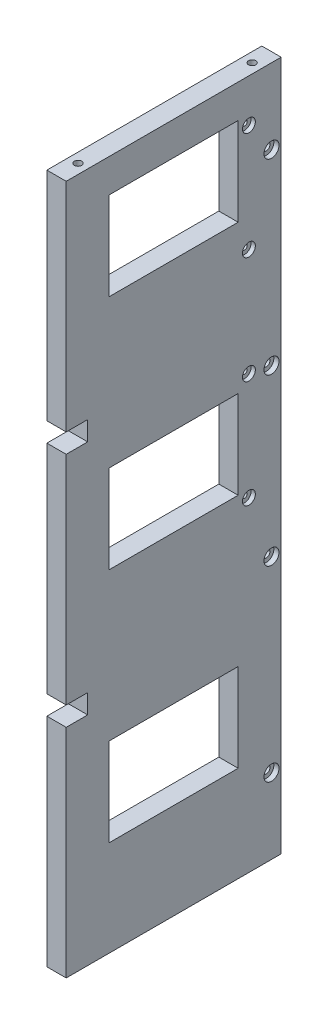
ISO-10303-21;
HEADER;
FILE_DESCRIPTION(('STEP AP214'),'2;1');
FILE_NAME('part.step','',(''),(''),'','','');
FILE_SCHEMA(('AUTOMOTIVE_DESIGN { 1 0 10303 214 1 1 1 1 }'));
ENDSEC;
DATA;
#1=APPLICATION_CONTEXT('core data for automotive mechanical design processes');
#2=APPLICATION_PROTOCOL_DEFINITION('international standard','automotive_design',2000,#1);
#3=PRODUCT_CONTEXT('',#1,'mechanical');
#4=PRODUCT('Part','Part','',(#3));
#5=PRODUCT_RELATED_PRODUCT_CATEGORY('part','',(#4));
#6=PRODUCT_DEFINITION_FORMATION('','',#4);
#7=PRODUCT_DEFINITION_CONTEXT('part definition',#1,'design');
#8=PRODUCT_DEFINITION('design','',#6,#7);
#9=PRODUCT_DEFINITION_SHAPE('','',#8);
#10=(LENGTH_UNIT() NAMED_UNIT(*) SI_UNIT(.MILLI.,.METRE.));
#11=(NAMED_UNIT(*) PLANE_ANGLE_UNIT() SI_UNIT($,.RADIAN.));
#12=(NAMED_UNIT(*) SI_UNIT($,.STERADIAN.) SOLID_ANGLE_UNIT());
#13=UNCERTAINTY_MEASURE_WITH_UNIT(LENGTH_MEASURE(1.E-05),#10,'distance_accuracy_value','');
#14=(GEOMETRIC_REPRESENTATION_CONTEXT(3) GLOBAL_UNCERTAINTY_ASSIGNED_CONTEXT((#13)) GLOBAL_UNIT_ASSIGNED_CONTEXT((#10,
#11,#12)) REPRESENTATION_CONTEXT('',''));
#15=CARTESIAN_POINT('',(0.,0.,0.));
#16=DIRECTION('',(0.,0.,1.));
#17=DIRECTION('',(1.,0.,0.));
#18=AXIS2_PLACEMENT_3D('',#15,#16,#17);
#19=CARTESIAN_POINT('',(-135.,8.99999999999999,150.));
#20=DIRECTION('',(0.,0.,-1.));
#21=DIRECTION('',(-1.,0.,0.));
#22=AXIS2_PLACEMENT_3D('',#19,#20,#21);
#23=PLANE('',#22);
#24=DIRECTION('',(0.,1.,0.));
#25=VECTOR('',#24,1.);
#26=CARTESIAN_POINT('',(-126.,8.99999999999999,150.));
#27=LINE('',#26,#25);
#28=CARTESIAN_POINT('',(-126.,119.,150.));
#29=VERTEX_POINT('',#28);
#30=CARTESIAN_POINT('',(-126.,220.,150.));
#31=VERTEX_POINT('',#30);
#32=EDGE_CURVE('E201',#29,#31,#27,.T.);
#33=ORIENTED_EDGE('',*,*,#32,.T.);
#34=DIRECTION('',(-1.,0.,0.));
#35=VECTOR('',#34,1.);
#36=CARTESIAN_POINT('',(-116.,220.,150.));
#37=LINE('',#36,#35);
#38=CARTESIAN_POINT('',(-135.,220.,150.));
#39=VERTEX_POINT('',#38);
#40=EDGE_CURVE('E392',#31,#39,#37,.T.);
#41=ORIENTED_EDGE('',*,*,#40,.T.);
#42=DIRECTION('',(0.,1.,0.));
#43=VECTOR('',#42,1.);
#44=CARTESIAN_POINT('',(-135.,8.99999999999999,150.));
#45=LINE('',#44,#43);
#46=CARTESIAN_POINT('',(-135.,119.,150.));
#47=VERTEX_POINT('',#46);
#48=EDGE_CURVE('E240',#47,#39,#45,.T.);
#49=ORIENTED_EDGE('',*,*,#48,.F.);
#50=DIRECTION('',(1.,0.,0.));
#51=VECTOR('',#50,1.);
#52=CARTESIAN_POINT('',(-226.,119.,150.000000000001));
#53=LINE('',#52,#51);
#54=EDGE_CURVE('E402',#47,#29,#53,.T.);
#55=ORIENTED_EDGE('',*,*,#54,.T.);
#56=EDGE_LOOP('',(#33,#41,#49,#55));
#57=FACE_BOUND('',#56,.T.);
#58=ADVANCED_FACE('F35',(#57),#23,.F.);
#59=CARTESIAN_POINT('',(-126.,8.99999999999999,150.));
#60=VERTEX_POINT('',#59);
#61=CARTESIAN_POINT('',(-126.,110.,150.));
#62=VERTEX_POINT('',#61);
#63=EDGE_CURVE('E189',#60,#62,#27,.T.);
#64=ORIENTED_EDGE('',*,*,#63,.T.);
#65=DIRECTION('',(-1.,0.,0.));
#66=VECTOR('',#65,1.);
#67=CARTESIAN_POINT('',(-126.,110.,150.));
#68=LINE('',#67,#66);
#69=CARTESIAN_POINT('',(-135.,110.,150.));
#70=VERTEX_POINT('',#69);
#71=EDGE_CURVE('E396',#62,#70,#68,.T.);
#72=ORIENTED_EDGE('',*,*,#71,.T.);
#73=CARTESIAN_POINT('',(-135.,8.99999999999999,150.));
#74=VERTEX_POINT('',#73);
#75=EDGE_CURVE('E191',#74,#70,#45,.T.);
#76=ORIENTED_EDGE('',*,*,#75,.F.);
#77=DIRECTION('',(1.,0.,0.));
#78=VECTOR('',#77,1.);
#79=CARTESIAN_POINT('',(-135.,8.99999999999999,150.));
#80=LINE('',#79,#78);
#81=EDGE_CURVE('E171',#74,#60,#80,.T.);
#82=ORIENTED_EDGE('',*,*,#81,.T.);
#83=EDGE_LOOP('',(#64,#72,#76,#82));
#84=FACE_BOUND('',#83,.T.);
#85=ADVANCED_FACE('F186',(#84),#23,.F.);
#86=CARTESIAN_POINT('',(-135.,330.,150.));
#87=DIRECTION('',(0.,-1.,0.));
#88=DIRECTION('',(0.,0.,1.));
#89=AXIS2_PLACEMENT_3D('',#86,#87,#88);
#90=PLANE('',#89);
#91=CARTESIAN_POINT('',(-130.5,330.,59.));
#92=DIRECTION('',(0.,-1.,0.));
#93=DIRECTION('',(0.,0.,1.));
#94=AXIS2_PLACEMENT_3D('',#91,#92,#93);
#95=CIRCLE('',#94,1.69999999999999);
#96=CARTESIAN_POINT('',(-130.5,330.,60.7));
#97=VERTEX_POINT('',#96);
#98=EDGE_CURVE('E81',#97,#97,#95,.T.);
#99=ORIENTED_EDGE('',*,*,#98,.T.);
#100=EDGE_LOOP('',(#99));
#101=FACE_BOUND('',#100,.T.);
#102=CARTESIAN_POINT('',(-130.5,330.,140.));
#103=DIRECTION('',(0.,-1.,0.));
#104=DIRECTION('',(0.,0.,1.));
#105=AXIS2_PLACEMENT_3D('',#102,#103,#104);
#106=CIRCLE('',#105,1.69999999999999);
#107=CARTESIAN_POINT('',(-130.5,330.,141.7));
#108=VERTEX_POINT('',#107);
#109=EDGE_CURVE('E141',#108,#108,#106,.T.);
#110=ORIENTED_EDGE('',*,*,#109,.T.);
#111=EDGE_LOOP('',(#110));
#112=FACE_BOUND('',#111,.T.);
#113=DIRECTION('',(0.,0.,-1.));
#114=VECTOR('',#113,1.);
#115=CARTESIAN_POINT('',(-126.,330.,150.));
#116=LINE('',#115,#114);
#117=CARTESIAN_POINT('',(-126.,330.,150.));
#118=VERTEX_POINT('',#117);
#119=CARTESIAN_POINT('',(-126.,330.,49.9999999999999));
#120=VERTEX_POINT('',#119);
#121=EDGE_CURVE('E229',#118,#120,#116,.T.);
#122=ORIENTED_EDGE('',*,*,#121,.T.);
#123=DIRECTION('',(1.,0.,0.));
#124=VECTOR('',#123,1.);
#125=CARTESIAN_POINT('',(-135.,330.,50.));
#126=LINE('',#125,#124);
#127=CARTESIAN_POINT('',(-135.,330.,50.));
#128=VERTEX_POINT('',#127);
#129=EDGE_CURVE('E644',#128,#120,#126,.T.);
#130=ORIENTED_EDGE('',*,*,#129,.F.);
#131=DIRECTION('',(0.,0.,-1.));
#132=VECTOR('',#131,1.);
#133=CARTESIAN_POINT('',(-135.,330.,150.));
#134=LINE('',#133,#132);
#135=CARTESIAN_POINT('',(-135.,330.,150.));
#136=VERTEX_POINT('',#135);
#137=EDGE_CURVE('E200',#136,#128,#134,.T.);
#138=ORIENTED_EDGE('',*,*,#137,.F.);
#139=DIRECTION('',(1.,0.,0.));
#140=VECTOR('',#139,1.);
#141=CARTESIAN_POINT('',(-135.,330.,150.));
#142=LINE('',#141,#140);
#143=EDGE_CURVE('E192',#136,#118,#142,.T.);
#144=ORIENTED_EDGE('',*,*,#143,.T.);
#145=EDGE_LOOP('',(#122,#130,#138,#144));
#146=FACE_BOUND('',#145,.T.);
#147=ADVANCED_FACE('F226',(#101,#112,#146),#90,.F.);
#148=CARTESIAN_POINT('',(-135.,330.,50.));
#149=DIRECTION('',(0.,0.,1.));
#150=DIRECTION('',(1.,0.,0.));
#151=AXIS2_PLACEMENT_3D('',#148,#149,#150);
#152=PLANE('',#151);
#153=DIRECTION('',(0.,-1.,0.));
#154=VECTOR('',#153,1.);
#155=CARTESIAN_POINT('',(-126.,330.,49.9999999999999));
#156=LINE('',#155,#154);
#157=CARTESIAN_POINT('',(-126.,9.,49.9999999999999));
#158=VERTEX_POINT('',#157);
#159=EDGE_CURVE('E182',#120,#158,#156,.T.);
#160=ORIENTED_EDGE('',*,*,#159,.T.);
#161=DIRECTION('',(1.,0.,0.));
#162=VECTOR('',#161,1.);
#163=CARTESIAN_POINT('',(-135.,9.,50.));
#164=LINE('',#163,#162);
#165=CARTESIAN_POINT('',(-135.,9.,50.));
#166=VERTEX_POINT('',#165);
#167=EDGE_CURVE('E175',#166,#158,#164,.T.);
#168=ORIENTED_EDGE('',*,*,#167,.F.);
#169=DIRECTION('',(0.,-1.,0.));
#170=VECTOR('',#169,1.);
#171=CARTESIAN_POINT('',(-135.,330.,50.));
#172=LINE('',#171,#170);
#173=EDGE_CURVE('E204',#128,#166,#172,.T.);
#174=ORIENTED_EDGE('',*,*,#173,.F.);
#175=ORIENTED_EDGE('',*,*,#129,.T.);
#176=EDGE_LOOP('',(#160,#168,#174,#175));
#177=FACE_BOUND('',#176,.T.);
#178=ADVANCED_FACE('F159',(#177),#152,.F.);
#179=CARTESIAN_POINT('',(-135.,9.,50.));
#180=DIRECTION('',(0.,1.,0.));
#181=DIRECTION('',(0.,0.,-1.));
#182=AXIS2_PLACEMENT_3D('',#179,#180,#181);
#183=PLANE('',#182);
#184=CARTESIAN_POINT('',(-130.5,8.99999999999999,140.));
#185=DIRECTION('',(0.,1.,0.));
#186=DIRECTION('',(0.,0.,-1.));
#187=AXIS2_PLACEMENT_3D('',#184,#185,#186);
#188=CIRCLE('',#187,1.69999999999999);
#189=CARTESIAN_POINT('',(-130.5,8.99999999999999,138.3));
#190=VERTEX_POINT('',#189);
#191=EDGE_CURVE('E116',#190,#190,#188,.T.);
#192=ORIENTED_EDGE('',*,*,#191,.T.);
#193=EDGE_LOOP('',(#192));
#194=FACE_BOUND('',#193,.T.);
#195=CARTESIAN_POINT('',(-130.5,9.,59.));
#196=DIRECTION('',(0.,1.,0.));
#197=DIRECTION('',(0.,0.,-1.));
#198=AXIS2_PLACEMENT_3D('',#195,#196,#197);
#199=CIRCLE('',#198,1.69999999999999);
#200=CARTESIAN_POINT('',(-130.5,9.,57.3));
#201=VERTEX_POINT('',#200);
#202=EDGE_CURVE('E111',#201,#201,#199,.T.);
#203=ORIENTED_EDGE('',*,*,#202,.T.);
#204=EDGE_LOOP('',(#203));
#205=FACE_BOUND('',#204,.T.);
#206=DIRECTION('',(0.,0.,1.));
#207=VECTOR('',#206,1.);
#208=CARTESIAN_POINT('',(-126.,9.,49.9999999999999));
#209=LINE('',#208,#207);
#210=EDGE_CURVE('E167',#158,#60,#209,.T.);
#211=ORIENTED_EDGE('',*,*,#210,.T.);
#212=ORIENTED_EDGE('',*,*,#81,.F.);
#213=DIRECTION('',(0.,0.,1.));
#214=VECTOR('',#213,1.);
#215=CARTESIAN_POINT('',(-135.,9.,50.));
#216=LINE('',#215,#214);
#217=EDGE_CURVE('E242',#166,#74,#216,.T.);
#218=ORIENTED_EDGE('',*,*,#217,.F.);
#219=ORIENTED_EDGE('',*,*,#167,.T.);
#220=EDGE_LOOP('',(#211,#212,#218,#219));
#221=FACE_BOUND('',#220,.T.);
#222=ADVANCED_FACE('F155',(#194,#205,#221),#183,.F.);
#223=CARTESIAN_POINT('',(-135.,229.,150.));
#224=VERTEX_POINT('',#223);
#225=EDGE_CURVE('E241',#224,#136,#45,.T.);
#226=ORIENTED_EDGE('',*,*,#225,.F.);
#227=DIRECTION('',(1.,0.,0.));
#228=VECTOR('',#227,1.);
#229=CARTESIAN_POINT('',(-226.,229.,150.000000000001));
#230=LINE('',#229,#228);
#231=CARTESIAN_POINT('',(-126.,229.,150.));
#232=VERTEX_POINT('',#231);
#233=EDGE_CURVE('E219',#224,#232,#230,.T.);
#234=ORIENTED_EDGE('',*,*,#233,.T.);
#235=EDGE_CURVE('E181',#232,#118,#27,.T.);
#236=ORIENTED_EDGE('',*,*,#235,.T.);
#237=ORIENTED_EDGE('',*,*,#143,.F.);
#238=EDGE_LOOP('',(#226,#234,#236,#237));
#239=FACE_BOUND('',#238,.T.);
#240=ADVANCED_FACE('F158',(#239),#23,.F.);
#241=CARTESIAN_POINT('',(-134.999999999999,0.,200.));
#242=DIRECTION('',(-1.,0.,0.));
#243=DIRECTION('',(0.,0.,1.));
#244=AXIS2_PLACEMENT_3D('',#241,#242,#243);
#245=PLANE('',#244);
#246=CARTESIAN_POINT('',(-135.,310.,65.));
#247=DIRECTION('',(-1.,0.,0.));
#248=DIRECTION('',(0.,0.,1.));
#249=AXIS2_PLACEMENT_3D('',#246,#247,#248);
#250=CIRCLE('',#249,2.5);
#251=CARTESIAN_POINT('',(-135.,310.,67.5));
#252=VERTEX_POINT('',#251);
#253=EDGE_CURVE('E468',#252,#252,#250,.T.);
#254=ORIENTED_EDGE('',*,*,#253,.F.);
#255=EDGE_LOOP('',(#254));
#256=FACE_BOUND('',#255,.T.);
#257=CARTESIAN_POINT('',(-135.,260.,65.));
#258=DIRECTION('',(-1.,0.,0.));
#259=DIRECTION('',(0.,0.,1.));
#260=AXIS2_PLACEMENT_3D('',#257,#258,#259);
#261=CIRCLE('',#260,2.5);
#262=CARTESIAN_POINT('',(-135.,260.,67.5));
#263=VERTEX_POINT('',#262);
#264=EDGE_CURVE('E137',#263,#263,#261,.T.);
#265=ORIENTED_EDGE('',*,*,#264,.F.);
#266=EDGE_LOOP('',(#265));
#267=FACE_BOUND('',#266,.T.);
#268=CARTESIAN_POINT('',(-135.,210.,65.));
#269=DIRECTION('',(-1.,0.,0.));
#270=DIRECTION('',(0.,0.,1.));
#271=AXIS2_PLACEMENT_3D('',#268,#269,#270);
#272=CIRCLE('',#271,2.5);
#273=CARTESIAN_POINT('',(-135.,210.,67.5));
#274=VERTEX_POINT('',#273);
#275=EDGE_CURVE('E132',#274,#274,#272,.T.);
#276=ORIENTED_EDGE('',*,*,#275,.F.);
#277=EDGE_LOOP('',(#276));
#278=FACE_BOUND('',#277,.T.);
#279=CARTESIAN_POINT('',(-135.,160.,65.));
#280=DIRECTION('',(-1.,0.,0.));
#281=DIRECTION('',(0.,0.,1.));
#282=AXIS2_PLACEMENT_3D('',#279,#280,#281);
#283=CIRCLE('',#282,2.5);
#284=CARTESIAN_POINT('',(-135.,160.,67.5));
#285=VERTEX_POINT('',#284);
#286=EDGE_CURVE('E127',#285,#285,#283,.T.);
#287=ORIENTED_EDGE('',*,*,#286,.F.);
#288=EDGE_LOOP('',(#287));
#289=FACE_BOUND('',#288,.T.);
#290=CARTESIAN_POINT('',(-135.,295.,54.5));
#291=DIRECTION('',(-1.,0.,0.));
#292=DIRECTION('',(0.,0.,1.));
#293=AXIS2_PLACEMENT_3D('',#290,#291,#292);
#294=CIRCLE('',#293,1.69999999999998);
#295=CARTESIAN_POINT('',(-135.,295.,56.2));
#296=VERTEX_POINT('',#295);
#297=EDGE_CURVE('E106',#296,#296,#294,.T.);
#298=ORIENTED_EDGE('',*,*,#297,.F.);
#299=EDGE_LOOP('',(#298));
#300=FACE_BOUND('',#299,.T.);
#301=CARTESIAN_POINT('',(-135.,208.,54.5));
#302=DIRECTION('',(-1.,0.,0.));
#303=DIRECTION('',(0.,0.,1.));
#304=AXIS2_PLACEMENT_3D('',#301,#302,#303);
#305=CIRCLE('',#304,1.70000000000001);
#306=CARTESIAN_POINT('',(-135.,208.,56.2));
#307=VERTEX_POINT('',#306);
#308=EDGE_CURVE('E101',#307,#307,#305,.T.);
#309=ORIENTED_EDGE('',*,*,#308,.F.);
#310=EDGE_LOOP('',(#309));
#311=FACE_BOUND('',#310,.T.);
#312=CARTESIAN_POINT('',(-135.,131.,54.5));
#313=DIRECTION('',(-1.,0.,0.));
#314=DIRECTION('',(0.,0.,1.));
#315=AXIS2_PLACEMENT_3D('',#312,#313,#314);
#316=CIRCLE('',#315,1.69999999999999);
#317=CARTESIAN_POINT('',(-135.,131.,56.2));
#318=VERTEX_POINT('',#317);
#319=EDGE_CURVE('E96',#318,#318,#316,.T.);
#320=ORIENTED_EDGE('',*,*,#319,.F.);
#321=EDGE_LOOP('',(#320));
#322=FACE_BOUND('',#321,.T.);
#323=CARTESIAN_POINT('',(-135.,44.,54.5));
#324=DIRECTION('',(-1.,0.,0.));
#325=DIRECTION('',(0.,0.,1.));
#326=AXIS2_PLACEMENT_3D('',#323,#324,#325);
#327=CIRCLE('',#326,1.69999999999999);
#328=CARTESIAN_POINT('',(-135.,44.,56.2));
#329=VERTEX_POINT('',#328);
#330=EDGE_CURVE('E82',#329,#329,#327,.T.);
#331=ORIENTED_EDGE('',*,*,#330,.F.);
#332=EDGE_LOOP('',(#331));
#333=FACE_BOUND('',#332,.T.);
#334=DIRECTION('',(0.,0.,1.));
#335=VECTOR('',#334,1.);
#336=CARTESIAN_POINT('',(-134.999999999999,220.,200.));
#337=LINE('',#336,#335);
#338=CARTESIAN_POINT('',(-135.,220.,140.));
#339=VERTEX_POINT('',#338);
#340=EDGE_CURVE('E356',#339,#39,#337,.T.);
#341=ORIENTED_EDGE('',*,*,#340,.F.);
#342=DIRECTION('',(0.,-1.,0.));
#343=VECTOR('',#342,1.);
#344=CARTESIAN_POINT('',(-135.,0.,140.));
#345=LINE('',#344,#343);
#346=CARTESIAN_POINT('',(-135.,229.,140.));
#347=VERTEX_POINT('',#346);
#348=EDGE_CURVE('E381',#347,#339,#345,.T.);
#349=ORIENTED_EDGE('',*,*,#348,.F.);
#350=DIRECTION('',(0.,0.,-1.));
#351=VECTOR('',#350,1.);
#352=CARTESIAN_POINT('',(-134.999999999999,229.,200.));
#353=LINE('',#352,#351);
#354=EDGE_CURVE('E378',#224,#347,#353,.T.);
#355=ORIENTED_EDGE('',*,*,#354,.F.);
#356=ORIENTED_EDGE('',*,*,#225,.T.);
#357=ORIENTED_EDGE('',*,*,#137,.T.);
#358=ORIENTED_EDGE('',*,*,#173,.T.);
#359=ORIENTED_EDGE('',*,*,#217,.T.);
#360=ORIENTED_EDGE('',*,*,#75,.T.);
#361=DIRECTION('',(0.,0.,1.));
#362=VECTOR('',#361,1.);
#363=CARTESIAN_POINT('',(-134.999999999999,110.,200.));
#364=LINE('',#363,#362);
#365=CARTESIAN_POINT('',(-135.,110.,140.));
#366=VERTEX_POINT('',#365);
#367=EDGE_CURVE('E383',#366,#70,#364,.T.);
#368=ORIENTED_EDGE('',*,*,#367,.F.);
#369=DIRECTION('',(0.,-1.,0.));
#370=VECTOR('',#369,1.);
#371=CARTESIAN_POINT('',(-135.,0.,140.));
#372=LINE('',#371,#370);
#373=CARTESIAN_POINT('',(-135.,119.,140.));
#374=VERTEX_POINT('',#373);
#375=EDGE_CURVE('E389',#374,#366,#372,.T.);
#376=ORIENTED_EDGE('',*,*,#375,.F.);
#377=DIRECTION('',(0.,0.,-1.));
#378=VECTOR('',#377,1.);
#379=CARTESIAN_POINT('',(-134.999999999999,119.,200.));
#380=LINE('',#379,#378);
#381=EDGE_CURVE('E386',#47,#374,#380,.T.);
#382=ORIENTED_EDGE('',*,*,#381,.F.);
#383=ORIENTED_EDGE('',*,*,#48,.T.);
#384=EDGE_LOOP('',(#341,#349,#355,#356,#357,#358,#359,#360,#368,#376,#382,#383));
#385=FACE_BOUND('',#384,.T.);
#386=DIRECTION('',(0.,1.,0.));
#387=VECTOR('',#386,1.);
#388=CARTESIAN_POINT('',(-135.,0.,130.));
#389=LINE('',#388,#387);
#390=CARTESIAN_POINT('',(-135.,53.5,130.));
#391=VERTEX_POINT('',#390);
#392=CARTESIAN_POINT('',(-135.,94.5,130.));
#393=VERTEX_POINT('',#392);
#394=EDGE_CURVE('E232',#391,#393,#389,.T.);
#395=ORIENTED_EDGE('',*,*,#394,.F.);
#396=DIRECTION('',(0.,0.,1.));
#397=VECTOR('',#396,1.);
#398=CARTESIAN_POINT('',(-134.999999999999,53.5,200.));
#399=LINE('',#398,#397);
#400=CARTESIAN_POINT('',(-135.,53.5,70.));
#401=VERTEX_POINT('',#400);
#402=EDGE_CURVE('E252',#401,#391,#399,.T.);
#403=ORIENTED_EDGE('',*,*,#402,.F.);
#404=DIRECTION('',(0.,-1.,0.));
#405=VECTOR('',#404,1.);
#406=CARTESIAN_POINT('',(-135.,0.,70.));
#407=LINE('',#406,#405);
#408=CARTESIAN_POINT('',(-135.,94.5,70.));
#409=VERTEX_POINT('',#408);
#410=EDGE_CURVE('E249',#409,#401,#407,.T.);
#411=ORIENTED_EDGE('',*,*,#410,.F.);
#412=DIRECTION('',(0.,0.,-1.));
#413=VECTOR('',#412,1.);
#414=CARTESIAN_POINT('',(-134.999999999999,94.5,200.));
#415=LINE('',#414,#413);
#416=EDGE_CURVE('E236',#393,#409,#415,.T.);
#417=ORIENTED_EDGE('',*,*,#416,.F.);
#418=EDGE_LOOP('',(#395,#403,#411,#417));
#419=FACE_BOUND('',#418,.T.);
#420=DIRECTION('',(0.,0.,-1.));
#421=VECTOR('',#420,1.);
#422=CARTESIAN_POINT('',(-134.999999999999,204.5,200.));
#423=LINE('',#422,#421);
#424=CARTESIAN_POINT('',(-135.,204.5,130.));
#425=VERTEX_POINT('',#424);
#426=CARTESIAN_POINT('',(-135.,204.5,70.));
#427=VERTEX_POINT('',#426);
#428=EDGE_CURVE('E255',#425,#427,#423,.T.);
#429=ORIENTED_EDGE('',*,*,#428,.F.);
#430=DIRECTION('',(0.,1.,0.));
#431=VECTOR('',#430,1.);
#432=CARTESIAN_POINT('',(-135.,0.,130.));
#433=LINE('',#432,#431);
#434=CARTESIAN_POINT('',(-135.,163.5,130.));
#435=VERTEX_POINT('',#434);
#436=EDGE_CURVE('E264',#435,#425,#433,.T.);
#437=ORIENTED_EDGE('',*,*,#436,.F.);
#438=DIRECTION('',(0.,0.,1.));
#439=VECTOR('',#438,1.);
#440=CARTESIAN_POINT('',(-134.999999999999,163.5,200.));
#441=LINE('',#440,#439);
#442=CARTESIAN_POINT('',(-135.,163.5,70.));
#443=VERTEX_POINT('',#442);
#444=EDGE_CURVE('E261',#443,#435,#441,.T.);
#445=ORIENTED_EDGE('',*,*,#444,.F.);
#446=DIRECTION('',(0.,-1.,0.));
#447=VECTOR('',#446,1.);
#448=CARTESIAN_POINT('',(-135.,0.,69.9999999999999));
#449=LINE('',#448,#447);
#450=EDGE_CURVE('E258',#427,#443,#449,.T.);
#451=ORIENTED_EDGE('',*,*,#450,.F.);
#452=EDGE_LOOP('',(#429,#437,#445,#451));
#453=FACE_BOUND('',#452,.T.);
#454=DIRECTION('',(0.,0.,-1.));
#455=VECTOR('',#454,1.);
#456=CARTESIAN_POINT('',(-134.999999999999,314.5,200.));
#457=LINE('',#456,#455);
#458=CARTESIAN_POINT('',(-135.,314.5,130.));
#459=VERTEX_POINT('',#458);
#460=CARTESIAN_POINT('',(-135.,314.5,70.));
#461=VERTEX_POINT('',#460);
#462=EDGE_CURVE('E267',#459,#461,#457,.T.);
#463=ORIENTED_EDGE('',*,*,#462,.F.);
#464=DIRECTION('',(0.,1.,0.));
#465=VECTOR('',#464,1.);
#466=CARTESIAN_POINT('',(-135.,0.,130.));
#467=LINE('',#466,#465);
#468=CARTESIAN_POINT('',(-135.,273.5,130.));
#469=VERTEX_POINT('',#468);
#470=EDGE_CURVE('E276',#469,#459,#467,.T.);
#471=ORIENTED_EDGE('',*,*,#470,.F.);
#472=DIRECTION('',(0.,0.,1.));
#473=VECTOR('',#472,1.);
#474=CARTESIAN_POINT('',(-134.999999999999,273.5,200.));
#475=LINE('',#474,#473);
#476=CARTESIAN_POINT('',(-135.,273.5,70.));
#477=VERTEX_POINT('',#476);
#478=EDGE_CURVE('E273',#477,#469,#475,.T.);
#479=ORIENTED_EDGE('',*,*,#478,.F.);
#480=DIRECTION('',(0.,-1.,0.));
#481=VECTOR('',#480,1.);
#482=CARTESIAN_POINT('',(-135.,0.,69.9999999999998));
#483=LINE('',#482,#481);
#484=EDGE_CURVE('E270',#461,#477,#483,.T.);
#485=ORIENTED_EDGE('',*,*,#484,.F.);
#486=EDGE_LOOP('',(#463,#471,#479,#485));
#487=FACE_BOUND('',#486,.T.);
#488=ADVANCED_FACE('F474',(#256,#267,#278,#289,#300,#311,#322,#333,#385,#419,#453,#487),#245,.T.);
#489=CARTESIAN_POINT('',(-125.999999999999,0.,200.));
#490=DIRECTION('',(-1.,0.,0.));
#491=DIRECTION('',(0.,0.,1.));
#492=AXIS2_PLACEMENT_3D('',#489,#490,#491);
#493=PLANE('',#492);
#494=CARTESIAN_POINT('',(-126.,295.,54.4999999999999));
#495=DIRECTION('',(1.,0.,0.));
#496=DIRECTION('',(0.,0.,-1.));
#497=AXIS2_PLACEMENT_3D('',#494,#495,#496);
#498=CIRCLE('',#497,3.5);
#499=CARTESIAN_POINT('',(-126.,295.,50.9999999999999));
#500=VERTEX_POINT('',#499);
#501=EDGE_CURVE('E114',#500,#500,#498,.T.);
#502=ORIENTED_EDGE('',*,*,#501,.F.);
#503=EDGE_LOOP('',(#502));
#504=FACE_BOUND('',#503,.T.);
#505=CARTESIAN_POINT('',(-126.,208.,54.4999999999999));
#506=DIRECTION('',(1.,0.,0.));
#507=DIRECTION('',(0.,0.,-1.));
#508=AXIS2_PLACEMENT_3D('',#505,#506,#507);
#509=CIRCLE('',#508,3.5);
#510=CARTESIAN_POINT('',(-126.,208.,50.9999999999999));
#511=VERTEX_POINT('',#510);
#512=EDGE_CURVE('E109',#511,#511,#509,.T.);
#513=ORIENTED_EDGE('',*,*,#512,.F.);
#514=EDGE_LOOP('',(#513));
#515=FACE_BOUND('',#514,.T.);
#516=CARTESIAN_POINT('',(-126.,131.,54.4999999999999));
#517=DIRECTION('',(1.,0.,0.));
#518=DIRECTION('',(0.,0.,-1.));
#519=AXIS2_PLACEMENT_3D('',#516,#517,#518);
#520=CIRCLE('',#519,3.5);
#521=CARTESIAN_POINT('',(-126.,131.,50.9999999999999));
#522=VERTEX_POINT('',#521);
#523=EDGE_CURVE('E104',#522,#522,#520,.T.);
#524=ORIENTED_EDGE('',*,*,#523,.F.);
#525=EDGE_LOOP('',(#524));
#526=FACE_BOUND('',#525,.T.);
#527=CARTESIAN_POINT('',(-126.,44.,54.4999999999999));
#528=DIRECTION('',(1.,0.,0.));
#529=DIRECTION('',(0.,0.,-1.));
#530=AXIS2_PLACEMENT_3D('',#527,#528,#529);
#531=CIRCLE('',#530,3.5);
#532=CARTESIAN_POINT('',(-126.,44.,50.9999999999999));
#533=VERTEX_POINT('',#532);
#534=EDGE_CURVE('E99',#533,#533,#531,.T.);
#535=ORIENTED_EDGE('',*,*,#534,.F.);
#536=EDGE_LOOP('',(#535));
#537=FACE_BOUND('',#536,.T.);
#538=CARTESIAN_POINT('',(-126.,160.,64.9999999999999));
#539=DIRECTION('',(1.,0.,0.));
#540=DIRECTION('',(0.,0.,-1.));
#541=AXIS2_PLACEMENT_3D('',#538,#539,#540);
#542=CIRCLE('',#541,2.99999999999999);
#543=CARTESIAN_POINT('',(-126.,160.,62.));
#544=VERTEX_POINT('',#543);
#545=EDGE_CURVE('E371',#544,#544,#542,.T.);
#546=ORIENTED_EDGE('',*,*,#545,.F.);
#547=EDGE_LOOP('',(#546));
#548=FACE_BOUND('',#547,.T.);
#549=CARTESIAN_POINT('',(-126.,210.,64.9999999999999));
#550=DIRECTION('',(1.,0.,0.));
#551=DIRECTION('',(0.,0.,-1.));
#552=AXIS2_PLACEMENT_3D('',#549,#550,#551);
#553=CIRCLE('',#552,2.99999999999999);
#554=CARTESIAN_POINT('',(-126.,210.,62.));
#555=VERTEX_POINT('',#554);
#556=EDGE_CURVE('E365',#555,#555,#553,.T.);
#557=ORIENTED_EDGE('',*,*,#556,.F.);
#558=EDGE_LOOP('',(#557));
#559=FACE_BOUND('',#558,.T.);
#560=CARTESIAN_POINT('',(-126.,260.,64.9999999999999));
#561=DIRECTION('',(1.,0.,0.));
#562=DIRECTION('',(0.,0.,-1.));
#563=AXIS2_PLACEMENT_3D('',#560,#561,#562);
#564=CIRCLE('',#563,2.99999999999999);
#565=CARTESIAN_POINT('',(-126.,260.,62.));
#566=VERTEX_POINT('',#565);
#567=EDGE_CURVE('E359',#566,#566,#564,.T.);
#568=ORIENTED_EDGE('',*,*,#567,.F.);
#569=EDGE_LOOP('',(#568));
#570=FACE_BOUND('',#569,.T.);
#571=CARTESIAN_POINT('',(-126.,310.,64.9999999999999));
#572=DIRECTION('',(1.,0.,0.));
#573=DIRECTION('',(0.,0.,-1.));
#574=AXIS2_PLACEMENT_3D('',#571,#572,#573);
#575=CIRCLE('',#574,2.99999999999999);
#576=CARTESIAN_POINT('',(-126.,310.,62.));
#577=VERTEX_POINT('',#576);
#578=EDGE_CURVE('E352',#577,#577,#575,.T.);
#579=ORIENTED_EDGE('',*,*,#578,.F.);
#580=EDGE_LOOP('',(#579));
#581=FACE_BOUND('',#580,.T.);
#582=DIRECTION('',(0.,0.,-1.));
#583=VECTOR('',#582,1.);
#584=CARTESIAN_POINT('',(-126.,53.5,130.));
#585=LINE('',#584,#583);
#586=CARTESIAN_POINT('',(-126.,53.5,130.));
#587=VERTEX_POINT('',#586);
#588=CARTESIAN_POINT('',(-126.,53.5,69.9999999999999));
#589=VERTEX_POINT('',#588);
#590=EDGE_CURVE('E347',#587,#589,#585,.T.);
#591=ORIENTED_EDGE('',*,*,#590,.F.);
#592=DIRECTION('',(0.,-1.,0.));
#593=VECTOR('',#592,1.);
#594=CARTESIAN_POINT('',(-126.,94.5,130.));
#595=LINE('',#594,#593);
#596=CARTESIAN_POINT('',(-126.,94.5,130.));
#597=VERTEX_POINT('',#596);
#598=EDGE_CURVE('E319',#597,#587,#595,.T.);
#599=ORIENTED_EDGE('',*,*,#598,.F.);
#600=DIRECTION('',(0.,0.,1.));
#601=VECTOR('',#600,1.);
#602=CARTESIAN_POINT('',(-126.,94.5,130.));
#603=LINE('',#602,#601);
#604=CARTESIAN_POINT('',(-126.,94.5,70.));
#605=VERTEX_POINT('',#604);
#606=EDGE_CURVE('E334',#605,#597,#603,.T.);
#607=ORIENTED_EDGE('',*,*,#606,.F.);
#608=DIRECTION('',(0.,1.,0.));
#609=VECTOR('',#608,1.);
#610=CARTESIAN_POINT('',(-126.,94.5,70.));
#611=LINE('',#610,#609);
#612=EDGE_CURVE('E344',#589,#605,#611,.T.);
#613=ORIENTED_EDGE('',*,*,#612,.F.);
#614=EDGE_LOOP('',(#591,#599,#607,#613));
#615=FACE_BOUND('',#614,.T.);
#616=DIRECTION('',(0.,-1.,0.));
#617=VECTOR('',#616,1.);
#618=CARTESIAN_POINT('',(-126.,204.5,130.));
#619=LINE('',#618,#617);
#620=CARTESIAN_POINT('',(-126.,204.5,130.));
#621=VERTEX_POINT('',#620);
#622=CARTESIAN_POINT('',(-126.,163.5,130.));
#623=VERTEX_POINT('',#622);
#624=EDGE_CURVE('E325',#621,#623,#619,.T.);
#625=ORIENTED_EDGE('',*,*,#624,.F.);
#626=DIRECTION('',(0.,0.,1.));
#627=VECTOR('',#626,1.);
#628=CARTESIAN_POINT('',(-126.,204.5,130.));
#629=LINE('',#628,#627);
#630=CARTESIAN_POINT('',(-126.,204.5,70.));
#631=VERTEX_POINT('',#630);
#632=EDGE_CURVE('E293',#631,#621,#629,.T.);
#633=ORIENTED_EDGE('',*,*,#632,.F.);
#634=DIRECTION('',(0.,1.,0.));
#635=VECTOR('',#634,1.);
#636=CARTESIAN_POINT('',(-126.,204.5,70.));
#637=LINE('',#636,#635);
#638=CARTESIAN_POINT('',(-126.,163.5,69.9999999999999));
#639=VERTEX_POINT('',#638);
#640=EDGE_CURVE('E310',#639,#631,#637,.T.);
#641=ORIENTED_EDGE('',*,*,#640,.F.);
#642=DIRECTION('',(0.,0.,-1.));
#643=VECTOR('',#642,1.);
#644=CARTESIAN_POINT('',(-126.,163.5,130.));
#645=LINE('',#644,#643);
#646=EDGE_CURVE('E322',#623,#639,#645,.T.);
#647=ORIENTED_EDGE('',*,*,#646,.F.);
#648=EDGE_LOOP('',(#625,#633,#641,#647));
#649=FACE_BOUND('',#648,.T.);
#650=DIRECTION('',(0.,-1.,0.));
#651=VECTOR('',#650,1.);
#652=CARTESIAN_POINT('',(-126.,314.5,130.));
#653=LINE('',#652,#651);
#654=CARTESIAN_POINT('',(-126.,314.5,130.));
#655=VERTEX_POINT('',#654);
#656=CARTESIAN_POINT('',(-126.,273.5,130.));
#657=VERTEX_POINT('',#656);
#658=EDGE_CURVE('E299',#655,#657,#653,.T.);
#659=ORIENTED_EDGE('',*,*,#658,.F.);
#660=DIRECTION('',(0.,0.,1.));
#661=VECTOR('',#660,1.);
#662=CARTESIAN_POINT('',(-126.,314.5,130.));
#663=LINE('',#662,#661);
#664=CARTESIAN_POINT('',(-126.,314.5,69.9999999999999));
#665=VERTEX_POINT('',#664);
#666=EDGE_CURVE('E302',#665,#655,#663,.T.);
#667=ORIENTED_EDGE('',*,*,#666,.F.);
#668=DIRECTION('',(0.,1.,0.));
#669=VECTOR('',#668,1.);
#670=CARTESIAN_POINT('',(-126.,314.5,69.9999999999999));
#671=LINE('',#670,#669);
#672=CARTESIAN_POINT('',(-126.,273.5,69.9999999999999));
#673=VERTEX_POINT('',#672);
#674=EDGE_CURVE('E284',#673,#665,#671,.T.);
#675=ORIENTED_EDGE('',*,*,#674,.F.);
#676=DIRECTION('',(0.,0.,-1.));
#677=VECTOR('',#676,1.);
#678=CARTESIAN_POINT('',(-126.,273.5,130.));
#679=LINE('',#678,#677);
#680=EDGE_CURVE('E296',#657,#673,#679,.T.);
#681=ORIENTED_EDGE('',*,*,#680,.F.);
#682=EDGE_LOOP('',(#659,#667,#675,#681));
#683=FACE_BOUND('',#682,.T.);
#684=DIRECTION('',(0.,-1.,0.));
#685=VECTOR('',#684,1.);
#686=CARTESIAN_POINT('',(-126.,0.,140.));
#687=LINE('',#686,#685);
#688=CARTESIAN_POINT('',(-126.,229.,140.));
#689=VERTEX_POINT('',#688);
#690=CARTESIAN_POINT('',(-126.,220.,140.));
#691=VERTEX_POINT('',#690);
#692=EDGE_CURVE('E636',#689,#691,#687,.T.);
#693=ORIENTED_EDGE('',*,*,#692,.T.);
#694=DIRECTION('',(0.,0.,1.));
#695=VECTOR('',#694,1.);
#696=CARTESIAN_POINT('',(-125.999999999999,220.,200.));
#697=LINE('',#696,#695);
#698=EDGE_CURVE('E12',#691,#31,#697,.T.);
#699=ORIENTED_EDGE('',*,*,#698,.T.);
#700=ORIENTED_EDGE('',*,*,#32,.F.);
#701=DIRECTION('',(0.,0.,-1.));
#702=VECTOR('',#701,1.);
#703=CARTESIAN_POINT('',(-126.,119.,150.));
#704=LINE('',#703,#702);
#705=CARTESIAN_POINT('',(-126.,119.,140.));
#706=VERTEX_POINT('',#705);
#707=EDGE_CURVE('E393',#29,#706,#704,.T.);
#708=ORIENTED_EDGE('',*,*,#707,.T.);
#709=DIRECTION('',(0.,-1.,0.));
#710=VECTOR('',#709,1.);
#711=CARTESIAN_POINT('',(-126.,119.,140.));
#712=LINE('',#711,#710);
#713=CARTESIAN_POINT('',(-126.,110.,140.));
#714=VERTEX_POINT('',#713);
#715=EDGE_CURVE('E403',#706,#714,#712,.T.);
#716=ORIENTED_EDGE('',*,*,#715,.T.);
#717=DIRECTION('',(0.,0.,-1.));
#718=VECTOR('',#717,1.);
#719=CARTESIAN_POINT('',(-126.,110.,150.));
#720=LINE('',#719,#718);
#721=EDGE_CURVE('E199',#62,#714,#720,.T.);
#722=ORIENTED_EDGE('',*,*,#721,.F.);
#723=ORIENTED_EDGE('',*,*,#63,.F.);
#724=ORIENTED_EDGE('',*,*,#210,.F.);
#725=ORIENTED_EDGE('',*,*,#159,.F.);
#726=ORIENTED_EDGE('',*,*,#121,.F.);
#727=ORIENTED_EDGE('',*,*,#235,.F.);
#728=DIRECTION('',(0.,0.,-1.));
#729=VECTOR('',#728,1.);
#730=CARTESIAN_POINT('',(-125.999999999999,229.,200.));
#731=LINE('',#730,#729);
#732=EDGE_CURVE('E45',#232,#689,#731,.T.);
#733=ORIENTED_EDGE('',*,*,#732,.T.);
#734=EDGE_LOOP('',(#693,#699,#700,#708,#716,#722,#723,#724,#725,#726,#727,#733));
#735=FACE_BOUND('',#734,.T.);
#736=ADVANCED_FACE('F196',(#504,#515,#526,#537,#548,#559,#570,#581,#615,#649,#683,#735),#493,.F.);
#737=CARTESIAN_POINT('',(-298.670489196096,314.5,130.000000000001));
#738=DIRECTION('',(0.,1.,0.));
#739=DIRECTION('',(0.,0.,-1.));
#740=AXIS2_PLACEMENT_3D('',#737,#738,#739);
#741=PLANE('',#740);
#742=ORIENTED_EDGE('',*,*,#462,.T.);
#743=DIRECTION('',(1.,0.,0.));
#744=VECTOR('',#743,1.);
#745=CARTESIAN_POINT('',(-298.670489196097,314.5,70.0000000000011));
#746=LINE('',#745,#744);
#747=EDGE_CURVE('E290',#461,#665,#746,.T.);
#748=ORIENTED_EDGE('',*,*,#747,.T.);
#749=ORIENTED_EDGE('',*,*,#666,.T.);
#750=DIRECTION('',(1.,0.,0.));
#751=VECTOR('',#750,1.);
#752=CARTESIAN_POINT('',(-298.670489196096,314.5,130.000000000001));
#753=LINE('',#752,#751);
#754=EDGE_CURVE('E280',#459,#655,#753,.T.);
#755=ORIENTED_EDGE('',*,*,#754,.F.);
#756=EDGE_LOOP('',(#742,#748,#749,#755));
#757=FACE_BOUND('',#756,.T.);
#758=ADVANCED_FACE('F519',(#757),#741,.F.);
#759=CARTESIAN_POINT('',(-298.670489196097,314.5,70.0000000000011));
#760=DIRECTION('',(0.,0.,-1.));
#761=DIRECTION('',(0.,-1.,0.));
#762=AXIS2_PLACEMENT_3D('',#759,#760,#761);
#763=PLANE('',#762);
#764=ORIENTED_EDGE('',*,*,#484,.T.);
#765=DIRECTION('',(1.,0.,0.));
#766=VECTOR('',#765,1.);
#767=CARTESIAN_POINT('',(-298.670489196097,273.5,70.0000000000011));
#768=LINE('',#767,#766);
#769=EDGE_CURVE('E287',#477,#673,#768,.T.);
#770=ORIENTED_EDGE('',*,*,#769,.T.);
#771=ORIENTED_EDGE('',*,*,#674,.T.);
#772=ORIENTED_EDGE('',*,*,#747,.F.);
#773=EDGE_LOOP('',(#764,#770,#771,#772));
#774=FACE_BOUND('',#773,.T.);
#775=ADVANCED_FACE('F523',(#774),#763,.F.);
#776=CARTESIAN_POINT('',(-298.670489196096,273.5,130.000000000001));
#777=DIRECTION('',(0.,-1.,0.));
#778=DIRECTION('',(0.,0.,1.));
#779=AXIS2_PLACEMENT_3D('',#776,#777,#778);
#780=PLANE('',#779);
#781=ORIENTED_EDGE('',*,*,#478,.T.);
#782=DIRECTION('',(1.,0.,0.));
#783=VECTOR('',#782,1.);
#784=CARTESIAN_POINT('',(-298.670489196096,273.5,130.000000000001));
#785=LINE('',#784,#783);
#786=EDGE_CURVE('E283',#469,#657,#785,.T.);
#787=ORIENTED_EDGE('',*,*,#786,.T.);
#788=ORIENTED_EDGE('',*,*,#680,.T.);
#789=ORIENTED_EDGE('',*,*,#769,.F.);
#790=EDGE_LOOP('',(#781,#787,#788,#789));
#791=FACE_BOUND('',#790,.T.);
#792=ADVANCED_FACE('F544',(#791),#780,.F.);
#793=CARTESIAN_POINT('',(-298.670489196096,314.5,130.000000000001));
#794=DIRECTION('',(0.,0.,1.));
#795=DIRECTION('',(1.,0.,0.));
#796=AXIS2_PLACEMENT_3D('',#793,#794,#795);
#797=PLANE('',#796);
#798=ORIENTED_EDGE('',*,*,#470,.T.);
#799=ORIENTED_EDGE('',*,*,#754,.T.);
#800=ORIENTED_EDGE('',*,*,#658,.T.);
#801=ORIENTED_EDGE('',*,*,#786,.F.);
#802=EDGE_LOOP('',(#798,#799,#800,#801));
#803=FACE_BOUND('',#802,.T.);
#804=ADVANCED_FACE('F537',(#803),#797,.F.);
#805=CARTESIAN_POINT('',(-298.670489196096,204.5,130.000000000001));
#806=DIRECTION('',(0.,1.,0.));
#807=DIRECTION('',(0.,0.,-1.));
#808=AXIS2_PLACEMENT_3D('',#805,#806,#807);
#809=PLANE('',#808);
#810=ORIENTED_EDGE('',*,*,#428,.T.);
#811=DIRECTION('',(1.,0.,0.));
#812=VECTOR('',#811,1.);
#813=CARTESIAN_POINT('',(-298.670489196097,204.5,70.0000000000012));
#814=LINE('',#813,#812);
#815=EDGE_CURVE('E316',#427,#631,#814,.T.);
#816=ORIENTED_EDGE('',*,*,#815,.T.);
#817=ORIENTED_EDGE('',*,*,#632,.T.);
#818=DIRECTION('',(1.,0.,0.));
#819=VECTOR('',#818,1.);
#820=CARTESIAN_POINT('',(-298.670489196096,204.5,130.000000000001));
#821=LINE('',#820,#819);
#822=EDGE_CURVE('E306',#425,#621,#821,.T.);
#823=ORIENTED_EDGE('',*,*,#822,.F.);
#824=EDGE_LOOP('',(#810,#816,#817,#823));
#825=FACE_BOUND('',#824,.T.);
#826=ADVANCED_FACE('F713',(#825),#809,.F.);
#827=CARTESIAN_POINT('',(-298.670489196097,204.5,70.0000000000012));
#828=DIRECTION('',(0.,0.,-1.));
#829=DIRECTION('',(0.,-1.,0.));
#830=AXIS2_PLACEMENT_3D('',#827,#828,#829);
#831=PLANE('',#830);
#832=ORIENTED_EDGE('',*,*,#450,.T.);
#833=DIRECTION('',(1.,0.,0.));
#834=VECTOR('',#833,1.);
#835=CARTESIAN_POINT('',(-298.670489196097,163.5,70.0000000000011));
#836=LINE('',#835,#834);
#837=EDGE_CURVE('E313',#443,#639,#836,.T.);
#838=ORIENTED_EDGE('',*,*,#837,.T.);
#839=ORIENTED_EDGE('',*,*,#640,.T.);
#840=ORIENTED_EDGE('',*,*,#815,.F.);
#841=EDGE_LOOP('',(#832,#838,#839,#840));
#842=FACE_BOUND('',#841,.T.);
#843=ADVANCED_FACE('F720',(#842),#831,.F.);
#844=CARTESIAN_POINT('',(-298.670489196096,163.5,130.000000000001));
#845=DIRECTION('',(0.,-1.,0.));
#846=DIRECTION('',(0.,0.,1.));
#847=AXIS2_PLACEMENT_3D('',#844,#845,#846);
#848=PLANE('',#847);
#849=ORIENTED_EDGE('',*,*,#444,.T.);
#850=DIRECTION('',(1.,0.,0.));
#851=VECTOR('',#850,1.);
#852=CARTESIAN_POINT('',(-298.670489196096,163.5,130.000000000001));
#853=LINE('',#852,#851);
#854=EDGE_CURVE('E309',#435,#623,#853,.T.);
#855=ORIENTED_EDGE('',*,*,#854,.T.);
#856=ORIENTED_EDGE('',*,*,#646,.T.);
#857=ORIENTED_EDGE('',*,*,#837,.F.);
#858=EDGE_LOOP('',(#849,#855,#856,#857));
#859=FACE_BOUND('',#858,.T.);
#860=ADVANCED_FACE('F728',(#859),#848,.F.);
#861=CARTESIAN_POINT('',(-298.670489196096,204.5,130.000000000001));
#862=DIRECTION('',(0.,0.,1.));
#863=DIRECTION('',(1.,0.,0.));
#864=AXIS2_PLACEMENT_3D('',#861,#862,#863);
#865=PLANE('',#864);
#866=ORIENTED_EDGE('',*,*,#436,.T.);
#867=ORIENTED_EDGE('',*,*,#822,.T.);
#868=ORIENTED_EDGE('',*,*,#624,.T.);
#869=ORIENTED_EDGE('',*,*,#854,.F.);
#870=EDGE_LOOP('',(#866,#867,#868,#869));
#871=FACE_BOUND('',#870,.T.);
#872=ADVANCED_FACE('F736',(#871),#865,.F.);
#873=CARTESIAN_POINT('',(-298.670489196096,94.5,130.000000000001));
#874=DIRECTION('',(0.,0.,1.));
#875=DIRECTION('',(1.,0.,0.));
#876=AXIS2_PLACEMENT_3D('',#873,#874,#875);
#877=PLANE('',#876);
#878=ORIENTED_EDGE('',*,*,#394,.T.);
#879=DIRECTION('',(1.,0.,0.));
#880=VECTOR('',#879,1.);
#881=CARTESIAN_POINT('',(-298.670489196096,94.5,130.000000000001));
#882=LINE('',#881,#880);
#883=EDGE_CURVE('E279',#393,#597,#882,.T.);
#884=ORIENTED_EDGE('',*,*,#883,.T.);
#885=ORIENTED_EDGE('',*,*,#598,.T.);
#886=DIRECTION('',(1.,0.,0.));
#887=VECTOR('',#886,1.);
#888=CARTESIAN_POINT('',(-298.670489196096,53.5,130.000000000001));
#889=LINE('',#888,#887);
#890=EDGE_CURVE('E330',#391,#587,#889,.T.);
#891=ORIENTED_EDGE('',*,*,#890,.F.);
#892=EDGE_LOOP('',(#878,#884,#885,#891));
#893=FACE_BOUND('',#892,.T.);
#894=ADVANCED_FACE('F587',(#893),#877,.F.);
#895=CARTESIAN_POINT('',(-298.670489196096,94.5,130.000000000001));
#896=DIRECTION('',(0.,1.,0.));
#897=DIRECTION('',(0.,0.,-1.));
#898=AXIS2_PLACEMENT_3D('',#895,#896,#897);
#899=PLANE('',#898);
#900=ORIENTED_EDGE('',*,*,#416,.T.);
#901=DIRECTION('',(1.,0.,0.));
#902=VECTOR('',#901,1.);
#903=CARTESIAN_POINT('',(-298.670489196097,94.5,70.0000000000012));
#904=LINE('',#903,#902);
#905=EDGE_CURVE('E337',#409,#605,#904,.T.);
#906=ORIENTED_EDGE('',*,*,#905,.T.);
#907=ORIENTED_EDGE('',*,*,#606,.T.);
#908=ORIENTED_EDGE('',*,*,#883,.F.);
#909=EDGE_LOOP('',(#900,#906,#907,#908));
#910=FACE_BOUND('',#909,.T.);
#911=ADVANCED_FACE('F582',(#910),#899,.F.);
#912=CARTESIAN_POINT('',(-298.670489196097,94.5,70.0000000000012));
#913=DIRECTION('',(0.,0.,-1.));
#914=DIRECTION('',(0.,-1.,0.));
#915=AXIS2_PLACEMENT_3D('',#912,#913,#914);
#916=PLANE('',#915);
#917=ORIENTED_EDGE('',*,*,#410,.T.);
#918=DIRECTION('',(1.,0.,0.));
#919=VECTOR('',#918,1.);
#920=CARTESIAN_POINT('',(-298.670489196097,53.5,70.0000000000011));
#921=LINE('',#920,#919);
#922=EDGE_CURVE('E333',#401,#589,#921,.T.);
#923=ORIENTED_EDGE('',*,*,#922,.T.);
#924=ORIENTED_EDGE('',*,*,#612,.T.);
#925=ORIENTED_EDGE('',*,*,#905,.F.);
#926=EDGE_LOOP('',(#917,#923,#924,#925));
#927=FACE_BOUND('',#926,.T.);
#928=ADVANCED_FACE('F579',(#927),#916,.F.);
#929=CARTESIAN_POINT('',(-298.670489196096,53.5,130.000000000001));
#930=DIRECTION('',(0.,-1.,0.));
#931=DIRECTION('',(0.,0.,1.));
#932=AXIS2_PLACEMENT_3D('',#929,#930,#931);
#933=PLANE('',#932);
#934=ORIENTED_EDGE('',*,*,#402,.T.);
#935=ORIENTED_EDGE('',*,*,#890,.T.);
#936=ORIENTED_EDGE('',*,*,#590,.T.);
#937=ORIENTED_EDGE('',*,*,#922,.F.);
#938=EDGE_LOOP('',(#934,#935,#936,#937));
#939=FACE_BOUND('',#938,.T.);
#940=ADVANCED_FACE('F571',(#939),#933,.F.);
#941=CARTESIAN_POINT('',(-128.,310.,65.));
#942=DIRECTION('',(1.,0.,0.));
#943=DIRECTION('',(0.,0.,-1.));
#944=AXIS2_PLACEMENT_3D('',#941,#942,#943);
#945=CYLINDRICAL_SURFACE('',#944,2.99999999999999);
#946=CARTESIAN_POINT('',(-128.,310.,65.));
#947=DIRECTION('',(1.,0.,0.));
#948=DIRECTION('',(0.,0.,-1.));
#949=AXIS2_PLACEMENT_3D('',#946,#947,#948);
#950=CIRCLE('',#949,2.99999999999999);
#951=CARTESIAN_POINT('',(-128.,310.,62.));
#952=VERTEX_POINT('',#951);
#953=EDGE_CURVE('E355',#952,#952,#950,.T.);
#954=ORIENTED_EDGE('',*,*,#953,.F.);
#955=EDGE_LOOP('',(#954));
#956=FACE_BOUND('',#955,.T.);
#957=ORIENTED_EDGE('',*,*,#578,.T.);
#958=EDGE_LOOP('',(#957));
#959=FACE_BOUND('',#958,.T.);
#960=ADVANCED_FACE('F769',(#956,#959),#945,.F.);
#961=CARTESIAN_POINT('',(-128.,310.,65.));
#962=DIRECTION('',(1.,0.,0.));
#963=DIRECTION('',(0.,0.,-1.));
#964=AXIS2_PLACEMENT_3D('',#961,#962,#963);
#965=PLANE('',#964);
#966=CARTESIAN_POINT('',(-128.,310.,65.));
#967=DIRECTION('',(1.,0.,0.));
#968=DIRECTION('',(0.,0.,-1.));
#969=AXIS2_PLACEMENT_3D('',#966,#967,#968);
#970=CIRCLE('',#969,1.19999999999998);
#971=CARTESIAN_POINT('',(-128.,310.,63.8));
#972=VERTEX_POINT('',#971);
#973=EDGE_CURVE('E134',#972,#972,#970,.T.);
#974=ORIENTED_EDGE('',*,*,#973,.F.);
#975=EDGE_LOOP('',(#974));
#976=FACE_BOUND('',#975,.T.);
#977=ORIENTED_EDGE('',*,*,#953,.T.);
#978=EDGE_LOOP('',(#977));
#979=FACE_BOUND('',#978,.T.);
#980=ADVANCED_FACE('F776',(#976,#979),#965,.T.);
#981=CARTESIAN_POINT('',(-128.,260.,65.));
#982=DIRECTION('',(1.,0.,0.));
#983=DIRECTION('',(0.,0.,-1.));
#984=AXIS2_PLACEMENT_3D('',#981,#982,#983);
#985=CYLINDRICAL_SURFACE('',#984,2.99999999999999);
#986=CARTESIAN_POINT('',(-128.,260.,65.));
#987=DIRECTION('',(1.,0.,0.));
#988=DIRECTION('',(0.,0.,-1.));
#989=AXIS2_PLACEMENT_3D('',#986,#987,#988);
#990=CIRCLE('',#989,2.99999999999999);
#991=CARTESIAN_POINT('',(-128.,260.,62.));
#992=VERTEX_POINT('',#991);
#993=EDGE_CURVE('E362',#992,#992,#990,.T.);
#994=ORIENTED_EDGE('',*,*,#993,.F.);
#995=EDGE_LOOP('',(#994));
#996=FACE_BOUND('',#995,.T.);
#997=ORIENTED_EDGE('',*,*,#567,.T.);
#998=EDGE_LOOP('',(#997));
#999=FACE_BOUND('',#998,.T.);
#1000=ADVANCED_FACE('F784',(#996,#999),#985,.F.);
#1001=CARTESIAN_POINT('',(-128.,260.,65.));
#1002=DIRECTION('',(1.,0.,0.));
#1003=DIRECTION('',(0.,0.,-1.));
#1004=AXIS2_PLACEMENT_3D('',#1001,#1002,#1003);
#1005=PLANE('',#1004);
#1006=CARTESIAN_POINT('',(-128.,260.,65.));
#1007=DIRECTION('',(1.,0.,0.));
#1008=DIRECTION('',(0.,0.,-1.));
#1009=AXIS2_PLACEMENT_3D('',#1006,#1007,#1008);
#1010=CIRCLE('',#1009,1.19999999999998);
#1011=CARTESIAN_POINT('',(-128.,260.,63.8));
#1012=VERTEX_POINT('',#1011);
#1013=EDGE_CURVE('E129',#1012,#1012,#1010,.T.);
#1014=ORIENTED_EDGE('',*,*,#1013,.F.);
#1015=EDGE_LOOP('',(#1014));
#1016=FACE_BOUND('',#1015,.T.);
#1017=ORIENTED_EDGE('',*,*,#993,.T.);
#1018=EDGE_LOOP('',(#1017));
#1019=FACE_BOUND('',#1018,.T.);
#1020=ADVANCED_FACE('F792',(#1016,#1019),#1005,.T.);
#1021=CARTESIAN_POINT('',(-128.,210.,65.));
#1022=DIRECTION('',(1.,0.,0.));
#1023=DIRECTION('',(0.,0.,-1.));
#1024=AXIS2_PLACEMENT_3D('',#1021,#1022,#1023);
#1025=CYLINDRICAL_SURFACE('',#1024,2.99999999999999);
#1026=CARTESIAN_POINT('',(-128.,210.,65.));
#1027=DIRECTION('',(1.,0.,0.));
#1028=DIRECTION('',(0.,0.,-1.));
#1029=AXIS2_PLACEMENT_3D('',#1026,#1027,#1028);
#1030=CIRCLE('',#1029,2.99999999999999);
#1031=CARTESIAN_POINT('',(-128.,210.,62.));
#1032=VERTEX_POINT('',#1031);
#1033=EDGE_CURVE('E368',#1032,#1032,#1030,.T.);
#1034=ORIENTED_EDGE('',*,*,#1033,.F.);
#1035=EDGE_LOOP('',(#1034));
#1036=FACE_BOUND('',#1035,.T.);
#1037=ORIENTED_EDGE('',*,*,#556,.T.);
#1038=EDGE_LOOP('',(#1037));
#1039=FACE_BOUND('',#1038,.T.);
#1040=ADVANCED_FACE('F800',(#1036,#1039),#1025,.F.);
#1041=CARTESIAN_POINT('',(-128.,210.,65.));
#1042=DIRECTION('',(1.,0.,0.));
#1043=DIRECTION('',(0.,0.,-1.));
#1044=AXIS2_PLACEMENT_3D('',#1041,#1042,#1043);
#1045=PLANE('',#1044);
#1046=CARTESIAN_POINT('',(-128.,210.,65.));
#1047=DIRECTION('',(1.,0.,0.));
#1048=DIRECTION('',(0.,0.,-1.));
#1049=AXIS2_PLACEMENT_3D('',#1046,#1047,#1048);
#1050=CIRCLE('',#1049,1.20000000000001);
#1051=CARTESIAN_POINT('',(-128.,210.,63.8));
#1052=VERTEX_POINT('',#1051);
#1053=EDGE_CURVE('E124',#1052,#1052,#1050,.T.);
#1054=ORIENTED_EDGE('',*,*,#1053,.F.);
#1055=EDGE_LOOP('',(#1054));
#1056=FACE_BOUND('',#1055,.T.);
#1057=ORIENTED_EDGE('',*,*,#1033,.T.);
#1058=EDGE_LOOP('',(#1057));
#1059=FACE_BOUND('',#1058,.T.);
#1060=ADVANCED_FACE('F808',(#1056,#1059),#1045,.T.);
#1061=CARTESIAN_POINT('',(-128.,160.,65.));
#1062=DIRECTION('',(1.,0.,0.));
#1063=DIRECTION('',(0.,0.,-1.));
#1064=AXIS2_PLACEMENT_3D('',#1061,#1062,#1063);
#1065=CYLINDRICAL_SURFACE('',#1064,2.99999999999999);
#1066=CARTESIAN_POINT('',(-128.,160.,65.));
#1067=DIRECTION('',(1.,0.,0.));
#1068=DIRECTION('',(0.,0.,-1.));
#1069=AXIS2_PLACEMENT_3D('',#1066,#1067,#1068);
#1070=CIRCLE('',#1069,2.99999999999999);
#1071=CARTESIAN_POINT('',(-128.,160.,62.));
#1072=VERTEX_POINT('',#1071);
#1073=EDGE_CURVE('E305',#1072,#1072,#1070,.T.);
#1074=ORIENTED_EDGE('',*,*,#1073,.F.);
#1075=EDGE_LOOP('',(#1074));
#1076=FACE_BOUND('',#1075,.T.);
#1077=ORIENTED_EDGE('',*,*,#545,.T.);
#1078=EDGE_LOOP('',(#1077));
#1079=FACE_BOUND('',#1078,.T.);
#1080=ADVANCED_FACE('F816',(#1076,#1079),#1065,.F.);
#1081=CARTESIAN_POINT('',(-128.,160.,65.));
#1082=DIRECTION('',(1.,0.,0.));
#1083=DIRECTION('',(0.,0.,-1.));
#1084=AXIS2_PLACEMENT_3D('',#1081,#1082,#1083);
#1085=PLANE('',#1084);
#1086=CARTESIAN_POINT('',(-128.,160.,65.));
#1087=DIRECTION('',(1.,0.,0.));
#1088=DIRECTION('',(0.,0.,-1.));
#1089=AXIS2_PLACEMENT_3D('',#1086,#1087,#1088);
#1090=CIRCLE('',#1089,1.20000000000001);
#1091=CARTESIAN_POINT('',(-128.,160.,63.8));
#1092=VERTEX_POINT('',#1091);
#1093=EDGE_CURVE('E120',#1092,#1092,#1090,.T.);
#1094=ORIENTED_EDGE('',*,*,#1093,.F.);
#1095=EDGE_LOOP('',(#1094));
#1096=FACE_BOUND('',#1095,.T.);
#1097=ORIENTED_EDGE('',*,*,#1073,.T.);
#1098=EDGE_LOOP('',(#1097));
#1099=FACE_BOUND('',#1098,.T.);
#1100=ADVANCED_FACE('F824',(#1096,#1099),#1085,.T.);
#1101=CARTESIAN_POINT('',(-126.,110.,150.));
#1102=DIRECTION('',(0.,-1.,0.));
#1103=DIRECTION('',(0.,0.,1.));
#1104=AXIS2_PLACEMENT_3D('',#1101,#1102,#1103);
#1105=PLANE('',#1104);
#1106=ORIENTED_EDGE('',*,*,#367,.T.);
#1107=ORIENTED_EDGE('',*,*,#71,.F.);
#1108=ORIENTED_EDGE('',*,*,#721,.T.);
#1109=DIRECTION('',(-1.,0.,0.));
#1110=VECTOR('',#1109,1.);
#1111=CARTESIAN_POINT('',(-126.,110.,140.));
#1112=LINE('',#1111,#1110);
#1113=EDGE_CURVE('E399',#714,#366,#1112,.T.);
#1114=ORIENTED_EDGE('',*,*,#1113,.T.);
#1115=EDGE_LOOP('',(#1106,#1107,#1108,#1114));
#1116=FACE_BOUND('',#1115,.T.);
#1117=ADVANCED_FACE('F832',(#1116),#1105,.F.);
#1118=CARTESIAN_POINT('',(-226.,119.,150.000000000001));
#1119=DIRECTION('',(0.,1.,0.));
#1120=DIRECTION('',(0.,0.,-1.));
#1121=AXIS2_PLACEMENT_3D('',#1118,#1119,#1120);
#1122=PLANE('',#1121);
#1123=ORIENTED_EDGE('',*,*,#381,.T.);
#1124=DIRECTION('',(1.,0.,0.));
#1125=VECTOR('',#1124,1.);
#1126=CARTESIAN_POINT('',(-226.,119.,140.000000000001));
#1127=LINE('',#1126,#1125);
#1128=EDGE_CURVE('E405',#374,#706,#1127,.T.);
#1129=ORIENTED_EDGE('',*,*,#1128,.T.);
#1130=ORIENTED_EDGE('',*,*,#707,.F.);
#1131=ORIENTED_EDGE('',*,*,#54,.F.);
#1132=EDGE_LOOP('',(#1123,#1129,#1130,#1131));
#1133=FACE_BOUND('',#1132,.T.);
#1134=ADVANCED_FACE('F629',(#1133),#1122,.F.);
#1135=CARTESIAN_POINT('',(-261.,0.,140.000000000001));
#1136=DIRECTION('',(0.,0.,-1.));
#1137=DIRECTION('',(-1.,0.,0.));
#1138=AXIS2_PLACEMENT_3D('',#1135,#1136,#1137);
#1139=PLANE('',#1138);
#1140=ORIENTED_EDGE('',*,*,#375,.T.);
#1141=ORIENTED_EDGE('',*,*,#1113,.F.);
#1142=ORIENTED_EDGE('',*,*,#715,.F.);
#1143=ORIENTED_EDGE('',*,*,#1128,.F.);
#1144=EDGE_LOOP('',(#1140,#1141,#1142,#1143));
#1145=FACE_BOUND('',#1144,.T.);
#1146=ADVANCED_FACE('F847',(#1145),#1139,.F.);
#1147=CARTESIAN_POINT('',(-116.,220.,150.));
#1148=DIRECTION('',(0.,-1.,0.));
#1149=DIRECTION('',(0.,0.,1.));
#1150=AXIS2_PLACEMENT_3D('',#1147,#1148,#1149);
#1151=PLANE('',#1150);
#1152=ORIENTED_EDGE('',*,*,#340,.T.);
#1153=ORIENTED_EDGE('',*,*,#40,.F.);
#1154=ORIENTED_EDGE('',*,*,#698,.F.);
#1155=DIRECTION('',(-1.,0.,0.));
#1156=VECTOR('',#1155,1.);
#1157=CARTESIAN_POINT('',(-116.,220.,140.));
#1158=LINE('',#1157,#1156);
#1159=EDGE_CURVE('E54',#691,#339,#1158,.T.);
#1160=ORIENTED_EDGE('',*,*,#1159,.T.);
#1161=EDGE_LOOP('',(#1152,#1153,#1154,#1160));
#1162=FACE_BOUND('',#1161,.T.);
#1163=ADVANCED_FACE('F638',(#1162),#1151,.F.);
#1164=CARTESIAN_POINT('',(-226.,229.,150.000000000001));
#1165=DIRECTION('',(0.,1.,0.));
#1166=DIRECTION('',(0.,0.,-1.));
#1167=AXIS2_PLACEMENT_3D('',#1164,#1165,#1166);
#1168=PLANE('',#1167);
#1169=ORIENTED_EDGE('',*,*,#354,.T.);
#1170=DIRECTION('',(1.,0.,0.));
#1171=VECTOR('',#1170,1.);
#1172=CARTESIAN_POINT('',(-226.,229.,140.000000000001));
#1173=LINE('',#1172,#1171);
#1174=EDGE_CURVE('E398',#347,#689,#1173,.T.);
#1175=ORIENTED_EDGE('',*,*,#1174,.T.);
#1176=ORIENTED_EDGE('',*,*,#732,.F.);
#1177=ORIENTED_EDGE('',*,*,#233,.F.);
#1178=EDGE_LOOP('',(#1169,#1175,#1176,#1177));
#1179=FACE_BOUND('',#1178,.T.);
#1180=ADVANCED_FACE('F642',(#1179),#1168,.F.);
#1181=CARTESIAN_POINT('',(-261.,0.,140.000000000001));
#1182=DIRECTION('',(0.,0.,-1.));
#1183=DIRECTION('',(-1.,0.,0.));
#1184=AXIS2_PLACEMENT_3D('',#1181,#1182,#1183);
#1185=PLANE('',#1184);
#1186=ORIENTED_EDGE('',*,*,#348,.T.);
#1187=ORIENTED_EDGE('',*,*,#1159,.F.);
#1188=ORIENTED_EDGE('',*,*,#692,.F.);
#1189=ORIENTED_EDGE('',*,*,#1174,.F.);
#1190=EDGE_LOOP('',(#1186,#1187,#1188,#1189));
#1191=FACE_BOUND('',#1190,.T.);
#1192=ADVANCED_FACE('F643',(#1191),#1185,.F.);
#1193=CARTESIAN_POINT('',(-130.5,339.,140.));
#1194=DIRECTION('',(0.,1.,0.));
#1195=DIRECTION('',(0.,0.,-1.));
#1196=AXIS2_PLACEMENT_3D('',#1193,#1194,#1195);
#1197=CYLINDRICAL_SURFACE('',#1196,1.69999999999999);
#1198=CARTESIAN_POINT('',(-130.5,317.874975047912,140.));
#1199=DIRECTION('',(0.,1.,0.));
#1200=DIRECTION('',(0.,0.,1.));
#1201=AXIS2_PLACEMENT_3D('',#1198,#1199,#1200);
#1202=CIRCLE('',#1201,1.69999999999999);
#1203=CARTESIAN_POINT('',(-130.5,317.874975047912,141.7));
#1204=VERTEX_POINT('',#1203);
#1205=EDGE_CURVE('E84',#1204,#1204,#1202,.T.);
#1206=ORIENTED_EDGE('',*,*,#1205,.F.);
#1207=EDGE_LOOP('',(#1206));
#1208=FACE_BOUND('',#1207,.T.);
#1209=ORIENTED_EDGE('',*,*,#109,.F.);
#1210=EDGE_LOOP('',(#1209));
#1211=FACE_BOUND('',#1210,.T.);
#1212=ADVANCED_FACE('F653',(#1208,#1211),#1197,.F.);
#1213=CARTESIAN_POINT('',(-130.5,317.642875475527,140.));
#1214=DIRECTION('',(0.,1.,0.));
#1215=DIRECTION('',(0.,0.,-1.));
#1216=AXIS2_PLACEMENT_3D('',#1213,#1214,#1215);
#1217=CONICAL_SURFACE('',#1216,1.31372144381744,1.02974425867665);
#1218=CARTESIAN_POINT('',(-130.5,316.853511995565,140.));
#1219=VERTEX_POINT('',#1218);
#1220=VERTEX_LOOP('',#1219);
#1221=FACE_BOUND('',#1220,.T.);
#1222=ORIENTED_EDGE('',*,*,#1205,.T.);
#1223=EDGE_LOOP('',(#1222));
#1224=FACE_BOUND('',#1223,.T.);
#1225=ADVANCED_FACE('F655',(#1221,#1224),#1217,.F.);
#1226=CARTESIAN_POINT('',(-130.5,339.,59.));
#1227=DIRECTION('',(0.,1.,0.));
#1228=DIRECTION('',(0.,0.,-1.));
#1229=AXIS2_PLACEMENT_3D('',#1226,#1227,#1228);
#1230=CYLINDRICAL_SURFACE('',#1229,1.69999999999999);
#1231=CARTESIAN_POINT('',(-130.5,317.874975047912,59.));
#1232=DIRECTION('',(0.,1.,0.));
#1233=DIRECTION('',(0.,0.,1.));
#1234=AXIS2_PLACEMENT_3D('',#1231,#1232,#1233);
#1235=CIRCLE('',#1234,1.69999999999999);
#1236=CARTESIAN_POINT('',(-130.5,317.874975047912,60.7));
#1237=VERTEX_POINT('',#1236);
#1238=EDGE_CURVE('E39',#1237,#1237,#1235,.T.);
#1239=ORIENTED_EDGE('',*,*,#1238,.F.);
#1240=EDGE_LOOP('',(#1239));
#1241=FACE_BOUND('',#1240,.T.);
#1242=ORIENTED_EDGE('',*,*,#98,.F.);
#1243=EDGE_LOOP('',(#1242));
#1244=FACE_BOUND('',#1243,.T.);
#1245=ADVANCED_FACE('F76',(#1241,#1244),#1230,.F.);
#1246=CARTESIAN_POINT('',(-130.5,317.642875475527,59.));
#1247=DIRECTION('',(0.,1.,0.));
#1248=DIRECTION('',(0.,0.,-1.));
#1249=AXIS2_PLACEMENT_3D('',#1246,#1247,#1248);
#1250=CONICAL_SURFACE('',#1249,1.31372144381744,1.02974425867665);
#1251=CARTESIAN_POINT('',(-130.5,316.853511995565,59.));
#1252=VERTEX_POINT('',#1251);
#1253=VERTEX_LOOP('',#1252);
#1254=FACE_BOUND('',#1253,.T.);
#1255=ORIENTED_EDGE('',*,*,#1238,.T.);
#1256=EDGE_LOOP('',(#1255));
#1257=FACE_BOUND('',#1256,.T.);
#1258=ADVANCED_FACE('F72',(#1254,#1257),#1250,.F.);
#1259=CARTESIAN_POINT('',(-126.,44.,54.4999999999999));
#1260=DIRECTION('',(1.,0.,0.));
#1261=DIRECTION('',(0.,0.,-1.));
#1262=AXIS2_PLACEMENT_3D('',#1259,#1260,#1261);
#1263=CYLINDRICAL_SURFACE('',#1262,1.69999999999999);
#1264=ORIENTED_EDGE('',*,*,#330,.T.);
#1265=EDGE_LOOP('',(#1264));
#1266=FACE_BOUND('',#1265,.T.);
#1267=CARTESIAN_POINT('',(-128.4,44.,54.5));
#1268=DIRECTION('',(1.,0.,0.));
#1269=DIRECTION('',(0.,0.,-1.));
#1270=AXIS2_PLACEMENT_3D('',#1267,#1268,#1269);
#1271=CIRCLE('',#1270,1.69999999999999);
#1272=CARTESIAN_POINT('',(-128.4,44.,52.8));
#1273=VERTEX_POINT('',#1272);
#1274=EDGE_CURVE('E87',#1273,#1273,#1271,.T.);
#1275=ORIENTED_EDGE('',*,*,#1274,.T.);
#1276=EDGE_LOOP('',(#1275));
#1277=FACE_BOUND('',#1276,.T.);
#1278=ADVANCED_FACE('F75',(#1266,#1277),#1263,.F.);
#1279=CARTESIAN_POINT('',(-128.4,45.7,54.5));
#1280=DIRECTION('',(-1.,0.,0.));
#1281=DIRECTION('',(0.,0.,1.));
#1282=AXIS2_PLACEMENT_3D('',#1279,#1280,#1281);
#1283=PLANE('',#1282);
#1284=ORIENTED_EDGE('',*,*,#1274,.F.);
#1285=EDGE_LOOP('',(#1284));
#1286=FACE_BOUND('',#1285,.T.);
#1287=CARTESIAN_POINT('',(-128.4,44.,54.5));
#1288=DIRECTION('',(1.,0.,0.));
#1289=DIRECTION('',(0.,0.,-1.));
#1290=AXIS2_PLACEMENT_3D('',#1287,#1288,#1289);
#1291=CIRCLE('',#1290,3.5);
#1292=CARTESIAN_POINT('',(-128.4,44.,51.));
#1293=VERTEX_POINT('',#1292);
#1294=EDGE_CURVE('E92',#1293,#1293,#1291,.T.);
#1295=ORIENTED_EDGE('',*,*,#1294,.T.);
#1296=EDGE_LOOP('',(#1295));
#1297=FACE_BOUND('',#1296,.T.);
#1298=ADVANCED_FACE('F880',(#1286,#1297),#1283,.F.);
#1299=CARTESIAN_POINT('',(-126.,44.,54.4999999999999));
#1300=DIRECTION('',(1.,0.,0.));
#1301=DIRECTION('',(0.,0.,-1.));
#1302=AXIS2_PLACEMENT_3D('',#1299,#1300,#1301);
#1303=CYLINDRICAL_SURFACE('',#1302,3.5);
#1304=ORIENTED_EDGE('',*,*,#1294,.F.);
#1305=EDGE_LOOP('',(#1304));
#1306=FACE_BOUND('',#1305,.T.);
#1307=ORIENTED_EDGE('',*,*,#534,.T.);
#1308=EDGE_LOOP('',(#1307));
#1309=FACE_BOUND('',#1308,.T.);
#1310=ADVANCED_FACE('F890',(#1306,#1309),#1303,.F.);
#1311=CARTESIAN_POINT('',(-126.,131.,54.4999999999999));
#1312=DIRECTION('',(1.,0.,0.));
#1313=DIRECTION('',(0.,0.,-1.));
#1314=AXIS2_PLACEMENT_3D('',#1311,#1312,#1313);
#1315=CYLINDRICAL_SURFACE('',#1314,1.69999999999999);
#1316=ORIENTED_EDGE('',*,*,#319,.T.);
#1317=EDGE_LOOP('',(#1316));
#1318=FACE_BOUND('',#1317,.T.);
#1319=CARTESIAN_POINT('',(-128.4,131.,54.5));
#1320=DIRECTION('',(1.,0.,0.));
#1321=DIRECTION('',(0.,0.,-1.));
#1322=AXIS2_PLACEMENT_3D('',#1319,#1320,#1321);
#1323=CIRCLE('',#1322,1.70000000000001);
#1324=CARTESIAN_POINT('',(-128.4,131.,52.8));
#1325=VERTEX_POINT('',#1324);
#1326=EDGE_CURVE('E100',#1325,#1325,#1323,.T.);
#1327=ORIENTED_EDGE('',*,*,#1326,.T.);
#1328=EDGE_LOOP('',(#1327));
#1329=FACE_BOUND('',#1328,.T.);
#1330=ADVANCED_FACE('F901',(#1318,#1329),#1315,.F.);
#1331=CARTESIAN_POINT('',(-128.4,132.7,54.5));
#1332=DIRECTION('',(-1.,0.,0.));
#1333=DIRECTION('',(0.,0.,1.));
#1334=AXIS2_PLACEMENT_3D('',#1331,#1332,#1333);
#1335=PLANE('',#1334);
#1336=ORIENTED_EDGE('',*,*,#1326,.F.);
#1337=EDGE_LOOP('',(#1336));
#1338=FACE_BOUND('',#1337,.T.);
#1339=CARTESIAN_POINT('',(-128.4,131.,54.5));
#1340=DIRECTION('',(1.,0.,0.));
#1341=DIRECTION('',(0.,0.,-1.));
#1342=AXIS2_PLACEMENT_3D('',#1339,#1340,#1341);
#1343=CIRCLE('',#1342,3.5);
#1344=CARTESIAN_POINT('',(-128.4,131.,51.));
#1345=VERTEX_POINT('',#1344);
#1346=EDGE_CURVE('E423',#1345,#1345,#1343,.T.);
#1347=ORIENTED_EDGE('',*,*,#1346,.T.);
#1348=EDGE_LOOP('',(#1347));
#1349=FACE_BOUND('',#1348,.T.);
#1350=ADVANCED_FACE('F910',(#1338,#1349),#1335,.F.);
#1351=CARTESIAN_POINT('',(-126.,131.,54.4999999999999));
#1352=DIRECTION('',(1.,0.,0.));
#1353=DIRECTION('',(0.,0.,-1.));
#1354=AXIS2_PLACEMENT_3D('',#1351,#1352,#1353);
#1355=CYLINDRICAL_SURFACE('',#1354,3.5);
#1356=ORIENTED_EDGE('',*,*,#1346,.F.);
#1357=EDGE_LOOP('',(#1356));
#1358=FACE_BOUND('',#1357,.T.);
#1359=ORIENTED_EDGE('',*,*,#523,.T.);
#1360=EDGE_LOOP('',(#1359));
#1361=FACE_BOUND('',#1360,.T.);
#1362=ADVANCED_FACE('F920',(#1358,#1361),#1355,.F.);
#1363=CARTESIAN_POINT('',(-126.,208.,54.4999999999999));
#1364=DIRECTION('',(1.,0.,0.));
#1365=DIRECTION('',(0.,0.,-1.));
#1366=AXIS2_PLACEMENT_3D('',#1363,#1364,#1365);
#1367=CYLINDRICAL_SURFACE('',#1366,1.70000000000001);
#1368=ORIENTED_EDGE('',*,*,#308,.T.);
#1369=EDGE_LOOP('',(#1368));
#1370=FACE_BOUND('',#1369,.T.);
#1371=CARTESIAN_POINT('',(-128.4,208.,54.5));
#1372=DIRECTION('',(1.,0.,0.));
#1373=DIRECTION('',(0.,0.,-1.));
#1374=AXIS2_PLACEMENT_3D('',#1371,#1372,#1373);
#1375=CIRCLE('',#1374,1.70000000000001);
#1376=CARTESIAN_POINT('',(-128.4,208.,52.8));
#1377=VERTEX_POINT('',#1376);
#1378=EDGE_CURVE('E105',#1377,#1377,#1375,.T.);
#1379=ORIENTED_EDGE('',*,*,#1378,.T.);
#1380=EDGE_LOOP('',(#1379));
#1381=FACE_BOUND('',#1380,.T.);
#1382=ADVANCED_FACE('F931',(#1370,#1381),#1367,.F.);
#1383=CARTESIAN_POINT('',(-128.4,209.7,54.5));
#1384=DIRECTION('',(-1.,0.,0.));
#1385=DIRECTION('',(0.,0.,1.));
#1386=AXIS2_PLACEMENT_3D('',#1383,#1384,#1385);
#1387=PLANE('',#1386);
#1388=ORIENTED_EDGE('',*,*,#1378,.F.);
#1389=EDGE_LOOP('',(#1388));
#1390=FACE_BOUND('',#1389,.T.);
#1391=CARTESIAN_POINT('',(-128.4,208.,54.5));
#1392=DIRECTION('',(1.,0.,0.));
#1393=DIRECTION('',(0.,0.,-1.));
#1394=AXIS2_PLACEMENT_3D('',#1391,#1392,#1393);
#1395=CIRCLE('',#1394,3.5);
#1396=CARTESIAN_POINT('',(-128.4,208.,51.));
#1397=VERTEX_POINT('',#1396);
#1398=EDGE_CURVE('E430',#1397,#1397,#1395,.T.);
#1399=ORIENTED_EDGE('',*,*,#1398,.T.);
#1400=EDGE_LOOP('',(#1399));
#1401=FACE_BOUND('',#1400,.T.);
#1402=ADVANCED_FACE('F941',(#1390,#1401),#1387,.F.);
#1403=CARTESIAN_POINT('',(-126.,208.,54.4999999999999));
#1404=DIRECTION('',(1.,0.,0.));
#1405=DIRECTION('',(0.,0.,-1.));
#1406=AXIS2_PLACEMENT_3D('',#1403,#1404,#1405);
#1407=CYLINDRICAL_SURFACE('',#1406,3.5);
#1408=ORIENTED_EDGE('',*,*,#1398,.F.);
#1409=EDGE_LOOP('',(#1408));
#1410=FACE_BOUND('',#1409,.T.);
#1411=ORIENTED_EDGE('',*,*,#512,.T.);
#1412=EDGE_LOOP('',(#1411));
#1413=FACE_BOUND('',#1412,.T.);
#1414=ADVANCED_FACE('F951',(#1410,#1413),#1407,.F.);
#1415=CARTESIAN_POINT('',(-126.,295.,54.4999999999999));
#1416=DIRECTION('',(1.,0.,0.));
#1417=DIRECTION('',(0.,0.,-1.));
#1418=AXIS2_PLACEMENT_3D('',#1415,#1416,#1417);
#1419=CYLINDRICAL_SURFACE('',#1418,1.69999999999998);
#1420=ORIENTED_EDGE('',*,*,#297,.T.);
#1421=EDGE_LOOP('',(#1420));
#1422=FACE_BOUND('',#1421,.T.);
#1423=CARTESIAN_POINT('',(-128.4,295.,54.5));
#1424=DIRECTION('',(1.,0.,0.));
#1425=DIRECTION('',(0.,0.,-1.));
#1426=AXIS2_PLACEMENT_3D('',#1423,#1424,#1425);
#1427=CIRCLE('',#1426,1.69999999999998);
#1428=CARTESIAN_POINT('',(-128.4,295.,52.8));
#1429=VERTEX_POINT('',#1428);
#1430=EDGE_CURVE('E110',#1429,#1429,#1427,.T.);
#1431=ORIENTED_EDGE('',*,*,#1430,.T.);
#1432=EDGE_LOOP('',(#1431));
#1433=FACE_BOUND('',#1432,.T.);
#1434=ADVANCED_FACE('F961',(#1422,#1433),#1419,.F.);
#1435=CARTESIAN_POINT('',(-128.4,296.7,54.5));
#1436=DIRECTION('',(-1.,0.,0.));
#1437=DIRECTION('',(0.,0.,1.));
#1438=AXIS2_PLACEMENT_3D('',#1435,#1436,#1437);
#1439=PLANE('',#1438);
#1440=ORIENTED_EDGE('',*,*,#1430,.F.);
#1441=EDGE_LOOP('',(#1440));
#1442=FACE_BOUND('',#1441,.T.);
#1443=CARTESIAN_POINT('',(-128.4,295.,54.5));
#1444=DIRECTION('',(1.,0.,0.));
#1445=DIRECTION('',(0.,0.,-1.));
#1446=AXIS2_PLACEMENT_3D('',#1443,#1444,#1445);
#1447=CIRCLE('',#1446,3.5);
#1448=CARTESIAN_POINT('',(-128.4,295.,51.));
#1449=VERTEX_POINT('',#1448);
#1450=EDGE_CURVE('E437',#1449,#1449,#1447,.T.);
#1451=ORIENTED_EDGE('',*,*,#1450,.T.);
#1452=EDGE_LOOP('',(#1451));
#1453=FACE_BOUND('',#1452,.T.);
#1454=ADVANCED_FACE('F971',(#1442,#1453),#1439,.F.);
#1455=CARTESIAN_POINT('',(-126.,295.,54.4999999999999));
#1456=DIRECTION('',(1.,0.,0.));
#1457=DIRECTION('',(0.,0.,-1.));
#1458=AXIS2_PLACEMENT_3D('',#1455,#1456,#1457);
#1459=CYLINDRICAL_SURFACE('',#1458,3.5);
#1460=ORIENTED_EDGE('',*,*,#1450,.F.);
#1461=EDGE_LOOP('',(#1460));
#1462=FACE_BOUND('',#1461,.T.);
#1463=ORIENTED_EDGE('',*,*,#501,.T.);
#1464=EDGE_LOOP('',(#1463));
#1465=FACE_BOUND('',#1464,.T.);
#1466=ADVANCED_FACE('F151',(#1462,#1465),#1459,.F.);
#1467=CARTESIAN_POINT('',(-130.5,0.,59.));
#1468=DIRECTION('',(0.,-1.,0.));
#1469=DIRECTION('',(0.,0.,1.));
#1470=AXIS2_PLACEMENT_3D('',#1467,#1468,#1469);
#1471=CYLINDRICAL_SURFACE('',#1470,1.69999999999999);
#1472=CARTESIAN_POINT('',(-130.5,21.1250249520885,59.));
#1473=DIRECTION('',(0.,-1.,0.));
#1474=DIRECTION('',(0.,0.,-1.));
#1475=AXIS2_PLACEMENT_3D('',#1472,#1473,#1474);
#1476=CIRCLE('',#1475,1.69999999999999);
#1477=CARTESIAN_POINT('',(-130.5,21.1250249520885,57.3));
#1478=VERTEX_POINT('',#1477);
#1479=EDGE_CURVE('E115',#1478,#1478,#1476,.T.);
#1480=ORIENTED_EDGE('',*,*,#1479,.F.);
#1481=EDGE_LOOP('',(#1480));
#1482=FACE_BOUND('',#1481,.T.);
#1483=ORIENTED_EDGE('',*,*,#202,.F.);
#1484=EDGE_LOOP('',(#1483));
#1485=FACE_BOUND('',#1484,.T.);
#1486=ADVANCED_FACE('F148',(#1482,#1485),#1471,.F.);
#1487=CARTESIAN_POINT('',(-130.5,21.3571245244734,59.));
#1488=DIRECTION('',(0.,-1.,0.));
#1489=DIRECTION('',(0.,0.,1.));
#1490=AXIS2_PLACEMENT_3D('',#1487,#1488,#1489);
#1491=CONICAL_SURFACE('',#1490,1.31372144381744,1.02974425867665);
#1492=CARTESIAN_POINT('',(-130.5,22.1464880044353,59.));
#1493=VERTEX_POINT('',#1492);
#1494=VERTEX_LOOP('',#1493);
#1495=FACE_BOUND('',#1494,.T.);
#1496=ORIENTED_EDGE('',*,*,#1479,.T.);
#1497=EDGE_LOOP('',(#1496));
#1498=FACE_BOUND('',#1497,.T.);
#1499=ADVANCED_FACE('F146',(#1495,#1498),#1491,.F.);
#1500=CARTESIAN_POINT('',(-130.5,0.,140.));
#1501=DIRECTION('',(0.,-1.,0.));
#1502=DIRECTION('',(0.,0.,1.));
#1503=AXIS2_PLACEMENT_3D('',#1500,#1501,#1502);
#1504=CYLINDRICAL_SURFACE('',#1503,1.69999999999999);
#1505=CARTESIAN_POINT('',(-130.5,21.1250249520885,140.));
#1506=DIRECTION('',(0.,-1.,0.));
#1507=DIRECTION('',(0.,0.,-1.));
#1508=AXIS2_PLACEMENT_3D('',#1505,#1506,#1507);
#1509=CIRCLE('',#1508,1.69999999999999);
#1510=CARTESIAN_POINT('',(-130.5,21.1250249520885,138.3));
#1511=VERTEX_POINT('',#1510);
#1512=EDGE_CURVE('E119',#1511,#1511,#1509,.T.);
#1513=ORIENTED_EDGE('',*,*,#1512,.F.);
#1514=EDGE_LOOP('',(#1513));
#1515=FACE_BOUND('',#1514,.T.);
#1516=ORIENTED_EDGE('',*,*,#191,.F.);
#1517=EDGE_LOOP('',(#1516));
#1518=FACE_BOUND('',#1517,.T.);
#1519=ADVANCED_FACE('F1151',(#1515,#1518),#1504,.F.);
#1520=CARTESIAN_POINT('',(-130.5,21.3571245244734,140.));
#1521=DIRECTION('',(0.,-1.,0.));
#1522=DIRECTION('',(0.,0.,1.));
#1523=AXIS2_PLACEMENT_3D('',#1520,#1521,#1522);
#1524=CONICAL_SURFACE('',#1523,1.31372144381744,1.02974425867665);
#1525=CARTESIAN_POINT('',(-130.5,22.1464880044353,140.));
#1526=VERTEX_POINT('',#1525);
#1527=VERTEX_LOOP('',#1526);
#1528=FACE_BOUND('',#1527,.T.);
#1529=ORIENTED_EDGE('',*,*,#1512,.T.);
#1530=EDGE_LOOP('',(#1529));
#1531=FACE_BOUND('',#1530,.T.);
#1532=ADVANCED_FACE('F37',(#1528,#1531),#1524,.F.);
#1533=CARTESIAN_POINT('',(-135.,160.,65.));
#1534=DIRECTION('',(-1.,0.,0.));
#1535=DIRECTION('',(0.,0.,1.));
#1536=AXIS2_PLACEMENT_3D('',#1533,#1534,#1535);
#1537=CYLINDRICAL_SURFACE('',#1536,1.20000000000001);
#1538=ORIENTED_EDGE('',*,*,#1093,.T.);
#1539=EDGE_LOOP('',(#1538));
#1540=FACE_BOUND('',#1539,.T.);
#1541=CARTESIAN_POINT('',(-133.4,160.,65.));
#1542=DIRECTION('',(-1.,0.,0.));
#1543=DIRECTION('',(0.,0.,1.));
#1544=AXIS2_PLACEMENT_3D('',#1541,#1542,#1543);
#1545=CIRCLE('',#1544,1.20000000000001);
#1546=CARTESIAN_POINT('',(-133.4,160.,66.2));
#1547=VERTEX_POINT('',#1546);
#1548=EDGE_CURVE('E123',#1547,#1547,#1545,.T.);
#1549=ORIENTED_EDGE('',*,*,#1548,.T.);
#1550=EDGE_LOOP('',(#1549));
#1551=FACE_BOUND('',#1550,.T.);
#1552=ADVANCED_FACE('F996',(#1540,#1551),#1537,.F.);
#1553=CARTESIAN_POINT('',(-133.4,161.2,65.));
#1554=DIRECTION('',(1.,0.,0.));
#1555=DIRECTION('',(0.,0.,-1.));
#1556=AXIS2_PLACEMENT_3D('',#1553,#1554,#1555);
#1557=PLANE('',#1556);
#1558=ORIENTED_EDGE('',*,*,#1548,.F.);
#1559=EDGE_LOOP('',(#1558));
#1560=FACE_BOUND('',#1559,.T.);
#1561=CARTESIAN_POINT('',(-133.4,160.,65.));
#1562=DIRECTION('',(-1.,0.,0.));
#1563=DIRECTION('',(0.,0.,1.));
#1564=AXIS2_PLACEMENT_3D('',#1561,#1562,#1563);
#1565=CIRCLE('',#1564,2.5);
#1566=CARTESIAN_POINT('',(-133.4,160.,67.5));
#1567=VERTEX_POINT('',#1566);
#1568=EDGE_CURVE('E444',#1567,#1567,#1565,.T.);
#1569=ORIENTED_EDGE('',*,*,#1568,.T.);
#1570=EDGE_LOOP('',(#1569));
#1571=FACE_BOUND('',#1570,.T.);
#1572=ADVANCED_FACE('F1001',(#1560,#1571),#1557,.F.);
#1573=CARTESIAN_POINT('',(-135.,160.,65.));
#1574=DIRECTION('',(-1.,0.,0.));
#1575=DIRECTION('',(0.,0.,1.));
#1576=AXIS2_PLACEMENT_3D('',#1573,#1574,#1575);
#1577=CYLINDRICAL_SURFACE('',#1576,2.5);
#1578=ORIENTED_EDGE('',*,*,#1568,.F.);
#1579=EDGE_LOOP('',(#1578));
#1580=FACE_BOUND('',#1579,.T.);
#1581=ORIENTED_EDGE('',*,*,#286,.T.);
#1582=EDGE_LOOP('',(#1581));
#1583=FACE_BOUND('',#1582,.T.);
#1584=ADVANCED_FACE('F1014',(#1580,#1583),#1577,.F.);
#1585=CARTESIAN_POINT('',(-135.,210.,65.));
#1586=DIRECTION('',(-1.,0.,0.));
#1587=DIRECTION('',(0.,0.,1.));
#1588=AXIS2_PLACEMENT_3D('',#1585,#1586,#1587);
#1589=CYLINDRICAL_SURFACE('',#1588,1.20000000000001);
#1590=ORIENTED_EDGE('',*,*,#1053,.T.);
#1591=EDGE_LOOP('',(#1590));
#1592=FACE_BOUND('',#1591,.T.);
#1593=CARTESIAN_POINT('',(-133.4,210.,65.));
#1594=DIRECTION('',(-1.,0.,0.));
#1595=DIRECTION('',(0.,0.,1.));
#1596=AXIS2_PLACEMENT_3D('',#1593,#1594,#1595);
#1597=CIRCLE('',#1596,1.20000000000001);
#1598=CARTESIAN_POINT('',(-133.4,210.,66.2));
#1599=VERTEX_POINT('',#1598);
#1600=EDGE_CURVE('E128',#1599,#1599,#1597,.T.);
#1601=ORIENTED_EDGE('',*,*,#1600,.T.);
#1602=EDGE_LOOP('',(#1601));
#1603=FACE_BOUND('',#1602,.T.);
#1604=ADVANCED_FACE('F1024',(#1592,#1603),#1589,.F.);
#1605=CARTESIAN_POINT('',(-133.4,211.2,65.));
#1606=DIRECTION('',(1.,0.,0.));
#1607=DIRECTION('',(0.,0.,-1.));
#1608=AXIS2_PLACEMENT_3D('',#1605,#1606,#1607);
#1609=PLANE('',#1608);
#1610=ORIENTED_EDGE('',*,*,#1600,.F.);
#1611=EDGE_LOOP('',(#1610));
#1612=FACE_BOUND('',#1611,.T.);
#1613=CARTESIAN_POINT('',(-133.4,210.,65.));
#1614=DIRECTION('',(-1.,0.,0.));
#1615=DIRECTION('',(0.,0.,1.));
#1616=AXIS2_PLACEMENT_3D('',#1613,#1614,#1615);
#1617=CIRCLE('',#1616,2.5);
#1618=CARTESIAN_POINT('',(-133.4,210.,67.5));
#1619=VERTEX_POINT('',#1618);
#1620=EDGE_CURVE('E451',#1619,#1619,#1617,.T.);
#1621=ORIENTED_EDGE('',*,*,#1620,.T.);
#1622=EDGE_LOOP('',(#1621));
#1623=FACE_BOUND('',#1622,.T.);
#1624=ADVANCED_FACE('F1034',(#1612,#1623),#1609,.F.);
#1625=CARTESIAN_POINT('',(-135.,210.,65.));
#1626=DIRECTION('',(-1.,0.,0.));
#1627=DIRECTION('',(0.,0.,1.));
#1628=AXIS2_PLACEMENT_3D('',#1625,#1626,#1627);
#1629=CYLINDRICAL_SURFACE('',#1628,2.5);
#1630=ORIENTED_EDGE('',*,*,#1620,.F.);
#1631=EDGE_LOOP('',(#1630));
#1632=FACE_BOUND('',#1631,.T.);
#1633=ORIENTED_EDGE('',*,*,#275,.T.);
#1634=EDGE_LOOP('',(#1633));
#1635=FACE_BOUND('',#1634,.T.);
#1636=ADVANCED_FACE('F1045',(#1632,#1635),#1629,.F.);
#1637=CARTESIAN_POINT('',(-135.,260.,65.));
#1638=DIRECTION('',(-1.,0.,0.));
#1639=DIRECTION('',(0.,0.,1.));
#1640=AXIS2_PLACEMENT_3D('',#1637,#1638,#1639);
#1641=CYLINDRICAL_SURFACE('',#1640,1.19999999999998);
#1642=ORIENTED_EDGE('',*,*,#1013,.T.);
#1643=EDGE_LOOP('',(#1642));
#1644=FACE_BOUND('',#1643,.T.);
#1645=CARTESIAN_POINT('',(-133.4,260.,65.));
#1646=DIRECTION('',(-1.,0.,0.));
#1647=DIRECTION('',(0.,0.,1.));
#1648=AXIS2_PLACEMENT_3D('',#1645,#1646,#1647);
#1649=CIRCLE('',#1648,1.19999999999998);
#1650=CARTESIAN_POINT('',(-133.4,260.,66.2));
#1651=VERTEX_POINT('',#1650);
#1652=EDGE_CURVE('E133',#1651,#1651,#1649,.T.);
#1653=ORIENTED_EDGE('',*,*,#1652,.T.);
#1654=EDGE_LOOP('',(#1653));
#1655=FACE_BOUND('',#1654,.T.);
#1656=ADVANCED_FACE('F1055',(#1644,#1655),#1641,.F.);
#1657=CARTESIAN_POINT('',(-133.4,261.2,65.));
#1658=DIRECTION('',(1.,0.,0.));
#1659=DIRECTION('',(0.,0.,-1.));
#1660=AXIS2_PLACEMENT_3D('',#1657,#1658,#1659);
#1661=PLANE('',#1660);
#1662=ORIENTED_EDGE('',*,*,#1652,.F.);
#1663=EDGE_LOOP('',(#1662));
#1664=FACE_BOUND('',#1663,.T.);
#1665=CARTESIAN_POINT('',(-133.4,260.,65.));
#1666=DIRECTION('',(-1.,0.,0.));
#1667=DIRECTION('',(0.,0.,1.));
#1668=AXIS2_PLACEMENT_3D('',#1665,#1666,#1667);
#1669=CIRCLE('',#1668,2.5);
#1670=CARTESIAN_POINT('',(-133.4,260.,67.5));
#1671=VERTEX_POINT('',#1670);
#1672=EDGE_CURVE('E458',#1671,#1671,#1669,.T.);
#1673=ORIENTED_EDGE('',*,*,#1672,.T.);
#1674=EDGE_LOOP('',(#1673));
#1675=FACE_BOUND('',#1674,.T.);
#1676=ADVANCED_FACE('F1065',(#1664,#1675),#1661,.F.);
#1677=CARTESIAN_POINT('',(-135.,260.,65.));
#1678=DIRECTION('',(-1.,0.,0.));
#1679=DIRECTION('',(0.,0.,1.));
#1680=AXIS2_PLACEMENT_3D('',#1677,#1678,#1679);
#1681=CYLINDRICAL_SURFACE('',#1680,2.5);
#1682=ORIENTED_EDGE('',*,*,#1672,.F.);
#1683=EDGE_LOOP('',(#1682));
#1684=FACE_BOUND('',#1683,.T.);
#1685=ORIENTED_EDGE('',*,*,#264,.T.);
#1686=EDGE_LOOP('',(#1685));
#1687=FACE_BOUND('',#1686,.T.);
#1688=ADVANCED_FACE('F1075',(#1684,#1687),#1681,.F.);
#1689=CARTESIAN_POINT('',(-135.,310.,65.));
#1690=DIRECTION('',(-1.,0.,0.));
#1691=DIRECTION('',(0.,0.,1.));
#1692=AXIS2_PLACEMENT_3D('',#1689,#1690,#1691);
#1693=CYLINDRICAL_SURFACE('',#1692,1.19999999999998);
#1694=ORIENTED_EDGE('',*,*,#973,.T.);
#1695=EDGE_LOOP('',(#1694));
#1696=FACE_BOUND('',#1695,.T.);
#1697=CARTESIAN_POINT('',(-133.4,310.,65.));
#1698=DIRECTION('',(-1.,0.,0.));
#1699=DIRECTION('',(0.,0.,1.));
#1700=AXIS2_PLACEMENT_3D('',#1697,#1698,#1699);
#1701=CIRCLE('',#1700,1.19999999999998);
#1702=CARTESIAN_POINT('',(-133.4,310.,66.2));
#1703=VERTEX_POINT('',#1702);
#1704=EDGE_CURVE('E138',#1703,#1703,#1701,.T.);
#1705=ORIENTED_EDGE('',*,*,#1704,.T.);
#1706=EDGE_LOOP('',(#1705));
#1707=FACE_BOUND('',#1706,.T.);
#1708=ADVANCED_FACE('F1085',(#1696,#1707),#1693,.F.);
#1709=CARTESIAN_POINT('',(-133.4,311.2,65.));
#1710=DIRECTION('',(1.,0.,0.));
#1711=DIRECTION('',(0.,0.,-1.));
#1712=AXIS2_PLACEMENT_3D('',#1709,#1710,#1711);
#1713=PLANE('',#1712);
#1714=ORIENTED_EDGE('',*,*,#1704,.F.);
#1715=EDGE_LOOP('',(#1714));
#1716=FACE_BOUND('',#1715,.T.);
#1717=CARTESIAN_POINT('',(-133.4,310.,65.));
#1718=DIRECTION('',(-1.,0.,0.));
#1719=DIRECTION('',(0.,0.,1.));
#1720=AXIS2_PLACEMENT_3D('',#1717,#1718,#1719);
#1721=CIRCLE('',#1720,2.5);
#1722=CARTESIAN_POINT('',(-133.4,310.,67.5));
#1723=VERTEX_POINT('',#1722);
#1724=EDGE_CURVE('E465',#1723,#1723,#1721,.T.);
#1725=ORIENTED_EDGE('',*,*,#1724,.T.);
#1726=EDGE_LOOP('',(#1725));
#1727=FACE_BOUND('',#1726,.T.);
#1728=ADVANCED_FACE('F1095',(#1716,#1727),#1713,.F.);
#1729=CARTESIAN_POINT('',(-135.,310.,65.));
#1730=DIRECTION('',(-1.,0.,0.));
#1731=DIRECTION('',(0.,0.,1.));
#1732=AXIS2_PLACEMENT_3D('',#1729,#1730,#1731);
#1733=CYLINDRICAL_SURFACE('',#1732,2.5);
#1734=ORIENTED_EDGE('',*,*,#1724,.F.);
#1735=EDGE_LOOP('',(#1734));
#1736=FACE_BOUND('',#1735,.T.);
#1737=ORIENTED_EDGE('',*,*,#253,.T.);
#1738=EDGE_LOOP('',(#1737));
#1739=FACE_BOUND('',#1738,.T.);
#1740=ADVANCED_FACE('F472',(#1736,#1739),#1733,.F.);
#1741=CLOSED_SHELL('',(#58,#85,#147,#178,#222,#240,#488,#736,#758,#775,#792,#804,#826,#843,#860,
#872,#894,#911,#928,#940,#960,#980,#1000,#1020,#1040,#1060,#1080,#1100,#1117,#1134,#1146,#1163,
#1180,#1192,#1212,#1225,#1245,#1258,#1278,#1298,#1310,#1330,#1350,#1362,#1382,#1402,#1414,#1434,
#1454,#1466,#1486,#1499,#1519,#1532,#1552,#1572,#1584,#1604,#1624,#1636,#1656,#1676,#1688,#1708,
#1728,#1740));
#1742=MANIFOLD_SOLID_BREP('B2',#1741);
#1743=ADVANCED_BREP_SHAPE_REPRESENTATION('',(#18,#1742),#14);
#1744=SHAPE_DEFINITION_REPRESENTATION(#9,#1743);
ENDSEC;
END-ISO-10303-21;
